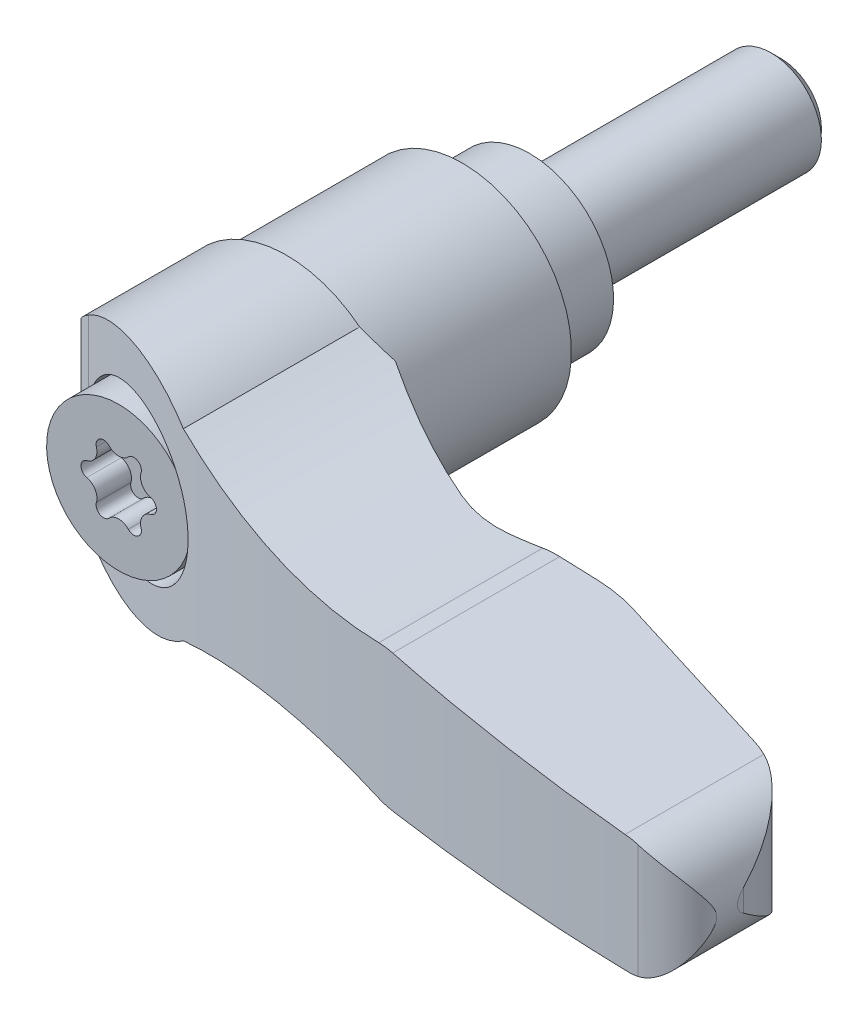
ISO-10303-21;
HEADER;
FILE_DESCRIPTION(('STEP AP214'),'2;1');
FILE_NAME('part.step','',(''),(''),'','','');
FILE_SCHEMA(('AUTOMOTIVE_DESIGN { 1 0 10303 214 1 1 1 1 }'));
ENDSEC;
DATA;
#1=APPLICATION_CONTEXT('core data for automotive mechanical design processes');
#2=APPLICATION_PROTOCOL_DEFINITION('international standard','automotive_design',2000,#1);
#3=PRODUCT_CONTEXT('',#1,'mechanical');
#4=PRODUCT('Part','Part','',(#3));
#5=PRODUCT_RELATED_PRODUCT_CATEGORY('part','',(#4));
#6=PRODUCT_DEFINITION_FORMATION('','',#4);
#7=PRODUCT_DEFINITION_CONTEXT('part definition',#1,'design');
#8=PRODUCT_DEFINITION('design','',#6,#7);
#9=PRODUCT_DEFINITION_SHAPE('','',#8);
#10=(LENGTH_UNIT() NAMED_UNIT(*) SI_UNIT(.MILLI.,.METRE.));
#11=(NAMED_UNIT(*) PLANE_ANGLE_UNIT() SI_UNIT($,.RADIAN.));
#12=(NAMED_UNIT(*) SI_UNIT($,.STERADIAN.) SOLID_ANGLE_UNIT());
#13=UNCERTAINTY_MEASURE_WITH_UNIT(LENGTH_MEASURE(1.E-05),#10,'distance_accuracy_value','');
#14=(GEOMETRIC_REPRESENTATION_CONTEXT(3) GLOBAL_UNCERTAINTY_ASSIGNED_CONTEXT((#13)) GLOBAL_UNIT_ASSIGNED_CONTEXT((#10,
#11,#12)) REPRESENTATION_CONTEXT('',''));
#15=CARTESIAN_POINT('',(0.,0.,0.));
#16=DIRECTION('',(0.,0.,1.));
#17=DIRECTION('',(1.,0.,0.));
#18=AXIS2_PLACEMENT_3D('',#15,#16,#17);
#19=CARTESIAN_POINT('',(0.,0.,-4.6928325));
#20=DIRECTION('',(0.,0.,-1.));
#21=DIRECTION('',(0.,1.,0.));
#22=AXIS2_PLACEMENT_3D('',#19,#20,#21);
#23=CYLINDRICAL_SURFACE('',#22,3.);
#24=CARTESIAN_POINT('',(0.,0.,-14.39));
#25=DIRECTION('',(0.,0.,-1.));
#26=DIRECTION('',(0.,1.,0.));
#27=AXIS2_PLACEMENT_3D('',#24,#25,#26);
#28=CIRCLE('',#27,3.);
#29=CARTESIAN_POINT('',(0.,3.,-14.39));
#30=VERTEX_POINT('',#29);
#31=EDGE_CURVE('E9',#30,#30,#28,.F.);
#32=ORIENTED_EDGE('',*,*,#31,.T.);
#33=EDGE_LOOP('',(#32));
#34=FACE_BOUND('',#33,.T.);
#35=CARTESIAN_POINT('',(0.,0.,0.));
#36=DIRECTION('',(0.,0.,-1.));
#37=DIRECTION('',(0.,1.,0.));
#38=AXIS2_PLACEMENT_3D('',#35,#36,#37);
#39=CIRCLE('',#38,3.);
#40=CARTESIAN_POINT('',(0.,3.,0.));
#41=VERTEX_POINT('',#40);
#42=EDGE_CURVE('E566',#41,#41,#39,.F.);
#43=ORIENTED_EDGE('',*,*,#42,.F.);
#44=EDGE_LOOP('',(#43));
#45=FACE_BOUND('',#44,.T.);
#46=ADVANCED_FACE('F15',(#34,#45),#23,.T.);
#47=CARTESIAN_POINT('',(4.,0.,0.));
#48=DIRECTION('',(0.,0.,-1.));
#49=DIRECTION('',(0.,1.,0.));
#50=AXIS2_PLACEMENT_3D('',#47,#48,#49);
#51=PLANE('',#50);
#52=ORIENTED_EDGE('',*,*,#42,.T.);
#53=EDGE_LOOP('',(#52));
#54=FACE_BOUND('',#53,.T.);
#55=CARTESIAN_POINT('',(0.,0.,0.));
#56=DIRECTION('',(0.,0.,-1.));
#57=DIRECTION('',(0.,1.,0.));
#58=AXIS2_PLACEMENT_3D('',#55,#56,#57);
#59=CIRCLE('',#58,5.);
#60=CARTESIAN_POINT('',(0.,5.,0.));
#61=VERTEX_POINT('',#60);
#62=EDGE_CURVE('E726',#61,#61,#59,.F.);
#63=ORIENTED_EDGE('',*,*,#62,.F.);
#64=EDGE_LOOP('',(#63));
#65=FACE_BOUND('',#64,.T.);
#66=ADVANCED_FACE('F669',(#54,#65),#51,.T.);
#67=CARTESIAN_POINT('',(0.,0.,6.4));
#68=DIRECTION('',(0.,0.,-1.));
#69=DIRECTION('',(0.,1.,0.));
#70=AXIS2_PLACEMENT_3D('',#67,#68,#69);
#71=CYLINDRICAL_SURFACE('',#70,5.);
#72=ORIENTED_EDGE('',*,*,#62,.T.);
#73=EDGE_LOOP('',(#72));
#74=FACE_BOUND('',#73,.T.);
#75=CARTESIAN_POINT('',(0.,0.,4.55000000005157));
#76=DIRECTION('',(0.,0.,-1.));
#77=DIRECTION('',(1.,0.,0.));
#78=AXIS2_PLACEMENT_3D('',#75,#76,#77);
#79=CIRCLE('',#78,4.99999999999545);
#80=CARTESIAN_POINT('',(4.99999999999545,0.,4.55000000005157));
#81=VERTEX_POINT('',#80);
#82=EDGE_CURVE('E559',#81,#81,#79,.T.);
#83=ORIENTED_EDGE('',*,*,#82,.T.);
#84=EDGE_LOOP('',(#83));
#85=FACE_BOUND('',#84,.T.);
#86=ADVANCED_FACE('F676',(#74,#85),#71,.T.);
#87=CARTESIAN_POINT('',(0.,0.,4.30000000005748));
#88=DIRECTION('',(0.,0.,-1.));
#89=DIRECTION('',(0.,1.,0.));
#90=AXIS2_PLACEMENT_3D('',#87,#88,#89);
#91=CONICAL_SURFACE('',#90,5.24999999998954,0.785398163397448);
#92=ORIENTED_EDGE('',*,*,#82,.F.);
#93=EDGE_LOOP('',(#92));
#94=FACE_BOUND('',#93,.T.);
#95=CARTESIAN_POINT('',(0.,0.,4.3));
#96=DIRECTION('',(0.,0.,-1.));
#97=DIRECTION('',(0.,1.,0.));
#98=AXIS2_PLACEMENT_3D('',#95,#96,#97);
#99=CIRCLE('',#98,5.25);
#100=CARTESIAN_POINT('',(0.,5.25,4.3));
#101=VERTEX_POINT('',#100);
#102=EDGE_CURVE('E555',#101,#101,#99,.T.);
#103=ORIENTED_EDGE('',*,*,#102,.T.);
#104=EDGE_LOOP('',(#103));
#105=FACE_BOUND('',#104,.T.);
#106=ADVANCED_FACE('F684',(#94,#105),#91,.F.);
#107=CARTESIAN_POINT('',(0.,0.,3.65));
#108=DIRECTION('',(0.,0.,-1.));
#109=DIRECTION('',(0.,1.,0.));
#110=AXIS2_PLACEMENT_3D('',#107,#108,#109);
#111=CYLINDRICAL_SURFACE('',#110,5.25);
#112=ORIENTED_EDGE('',*,*,#102,.F.);
#113=EDGE_LOOP('',(#112));
#114=FACE_BOUND('',#113,.T.);
#115=CARTESIAN_POINT('',(0.,0.,4.));
#116=DIRECTION('',(0.,0.,-1.));
#117=DIRECTION('',(0.,1.,0.));
#118=AXIS2_PLACEMENT_3D('',#115,#116,#117);
#119=CIRCLE('',#118,5.25);
#120=CARTESIAN_POINT('',(0.,5.25,4.));
#121=VERTEX_POINT('',#120);
#122=EDGE_CURVE('E714',#121,#121,#119,.F.);
#123=ORIENTED_EDGE('',*,*,#122,.F.);
#124=EDGE_LOOP('',(#123));
#125=FACE_BOUND('',#124,.T.);
#126=ADVANCED_FACE('F691',(#114,#125),#111,.F.);
#127=CARTESIAN_POINT('',(-6.36002265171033,-14.,4.));
#128=DIRECTION('',(0.707106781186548,0.,0.707106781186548));
#129=DIRECTION('',(-0.707106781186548,0.,0.707106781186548));
#130=AXIS2_PLACEMENT_3D('',#127,#128,#129);
#131=PLANE('',#130);
#132=DIRECTION('',(0.,1.,0.));
#133=VECTOR('',#132,1.);
#134=CARTESIAN_POINT('',(-6.36002265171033,0.,4.));
#135=LINE('',#134,#133);
#136=CARTESIAN_POINT('',(-6.36002265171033,-1.38824072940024,4.));
#137=VERTEX_POINT('',#136);
#138=CARTESIAN_POINT('',(-6.36002265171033,1.38824072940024,4.));
#139=VERTEX_POINT('',#138);
#140=EDGE_CURVE('E716',#137,#139,#135,.T.);
#141=ORIENTED_EDGE('',*,*,#140,.F.);
#142=CARTESIAN_POINT('',(-0.0100000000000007,0.,-2.35002265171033));
#143=DIRECTION('',(0.707106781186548,0.,0.707106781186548));
#144=DIRECTION('',(-0.707106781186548,0.,0.707106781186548));
#145=AXIS2_PLACEMENT_3D('',#142,#143,#144);
#146=ELLIPSE('',#145,9.19238815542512,6.5);
#147=EDGE_CURVE('E558',#139,#137,#146,.T.);
#148=ORIENTED_EDGE('',*,*,#147,.F.);
#149=EDGE_LOOP('',(#141,#148));
#150=FACE_BOUND('',#149,.T.);
#151=ADVANCED_FACE('F695',(#150),#131,.F.);
#152=CARTESIAN_POINT('',(-3.26,0.,4.));
#153=DIRECTION('',(0.,0.,-1.));
#154=DIRECTION('',(0.,1.,0.));
#155=AXIS2_PLACEMENT_3D('',#152,#153,#154);
#156=PLANE('',#155);
#157=CARTESIAN_POINT('',(-0.00999999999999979,0.,4.));
#158=DIRECTION('',(0.,0.,1.));
#159=DIRECTION('',(-1.,0.,0.));
#160=AXIS2_PLACEMENT_3D('',#157,#158,#159);
#161=CIRCLE('',#160,6.5);
#162=EDGE_CURVE('E710',#137,#139,#161,.T.);
#163=ORIENTED_EDGE('',*,*,#162,.F.);
#164=ORIENTED_EDGE('',*,*,#140,.T.);
#165=EDGE_LOOP('',(#163,#164));
#166=FACE_BOUND('',#165,.T.);
#167=ORIENTED_EDGE('',*,*,#122,.T.);
#168=EDGE_LOOP('',(#167));
#169=FACE_BOUND('',#168,.T.);
#170=ADVANCED_FACE('F698',(#166,#169),#156,.T.);
#171=CARTESIAN_POINT('',(39.9389658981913,-8.,27.2042491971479));
#172=DIRECTION('',(0.989626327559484,0.,-0.143665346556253));
#173=DIRECTION('',(0.143665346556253,0.,0.989626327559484));
#174=AXIS2_PLACEMENT_3D('',#171,#172,#173);
#175=PLANE('',#174);
#176=CARTESIAN_POINT('',(36.5,0.,3.51522972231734));
#177=DIRECTION('',(0.989626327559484,0.,-0.143665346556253));
#178=DIRECTION('',(0.143665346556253,0.,0.989626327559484));
#179=AXIS2_PLACEMENT_3D('',#176,#177,#178);
#180=ELLIPSE('',#179,24.3621728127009,3.5);
#181=CARTESIAN_POINT('',(39.9389658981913,-0.650779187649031,27.2042491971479));
#182=VERTEX_POINT('',#181);
#183=CARTESIAN_POINT('',(39.9389658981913,0.650779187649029,27.2042491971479));
#184=VERTEX_POINT('',#183);
#185=EDGE_CURVE('E462',#182,#184,#180,.F.);
#186=ORIENTED_EDGE('',*,*,#185,.F.);
#187=DIRECTION('',(0.,-1.,0.));
#188=VECTOR('',#187,1.);
#189=CARTESIAN_POINT('',(39.9389658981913,-8.,27.2042491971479));
#190=LINE('',#189,#188);
#191=EDGE_CURVE('E849',#184,#182,#190,.T.);
#192=ORIENTED_EDGE('',*,*,#191,.F.);
#193=EDGE_LOOP('',(#186,#192));
#194=FACE_BOUND('',#193,.T.);
#195=ADVANCED_FACE('F486',(#194),#175,.T.);
#196=CARTESIAN_POINT('',(33.8626602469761,-8.,28.0863544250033));
#197=DIRECTION('',(0.,-1.,0.));
#198=DIRECTION('',(1.,0.,0.));
#199=AXIS2_PLACEMENT_3D('',#196,#197,#198);
#200=CYLINDRICAL_SURFACE('',#199,6.14);
#201=ORIENTED_EDGE('',*,*,#191,.T.);
#202=CARTESIAN_POINT('',(36.5,-3.5,22.5416236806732));
#203=CARTESIAN_POINT('',(36.6061539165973,-3.50000941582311,22.5920863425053));
#204=CARTESIAN_POINT('',(36.7107657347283,-3.49517280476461,22.6456099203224));
#205=CARTESIAN_POINT('',(36.9160027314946,-3.47671082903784,22.758101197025));
#206=CARTESIAN_POINT('',(37.0166343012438,-3.46310021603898,22.8170596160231));
#207=CARTESIAN_POINT('',(37.2123479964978,-3.42816986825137,22.9392782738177));
#208=CARTESIAN_POINT('',(37.3074768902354,-3.40693163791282,23.002487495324));
#209=CARTESIAN_POINT('',(37.4929223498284,-3.3575759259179,23.13320682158));
#210=CARTESIAN_POINT('',(37.5832363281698,-3.32945478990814,23.2007191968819));
#211=CARTESIAN_POINT('',(37.7830795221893,-3.25850520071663,23.358740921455));
#212=CARTESIAN_POINT('',(37.8909927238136,-3.21376078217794,23.4504360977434));
#213=CARTESIAN_POINT('',(38.0982482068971,-3.11588681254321,23.6389903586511));
#214=CARTESIAN_POINT('',(38.1975840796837,-3.06275107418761,23.7358532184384));
#215=CARTESIAN_POINT('',(38.3880468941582,-2.94917464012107,23.9343090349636));
#216=CARTESIAN_POINT('',(38.4791322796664,-2.88870020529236,24.0359224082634));
#217=CARTESIAN_POINT('',(38.6526412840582,-2.76182607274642,24.2426721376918));
#218=CARTESIAN_POINT('',(38.7350674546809,-2.69542813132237,24.3478074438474));
#219=CARTESIAN_POINT('',(38.9229341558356,-2.52996933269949,24.6038856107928));
#220=CARTESIAN_POINT('',(39.0243159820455,-2.42850340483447,24.7562617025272));
#221=CARTESIAN_POINT('',(39.2111706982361,-2.21796613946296,25.0654781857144));
#222=CARTESIAN_POINT('',(39.2966363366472,-2.10889136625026,25.2223205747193));
#223=CARTESIAN_POINT('',(39.452222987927,-1.88493092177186,25.5392893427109));
#224=CARTESIAN_POINT('',(39.5223498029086,-1.77004746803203,25.699414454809));
#225=CARTESIAN_POINT('',(39.6478320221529,-1.53583460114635,26.0220530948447));
#226=CARTESIAN_POINT('',(39.7031929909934,-1.41650688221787,26.1845656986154));
#227=CARTESIAN_POINT('',(39.7933776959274,-1.1901857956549,26.4900634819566));
#228=CARTESIAN_POINT('',(39.8299343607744,-1.08360162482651,26.6328455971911));
#229=CARTESIAN_POINT('',(39.8923391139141,-0.86858691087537,26.918504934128));
#230=CARTESIAN_POINT('',(39.918226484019,-0.76016469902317,27.0613798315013));
#231=CARTESIAN_POINT('',(39.9389658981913,-0.650779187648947,27.204249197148));
#232=B_SPLINE_CURVE_WITH_KNOTS('',3,(#202,#203,#204,#205,#206,#207,#208,#209,#210,#211,#212,
#213,#214,#215,#216,#217,#218,#219,#220,#221,#222,#223,#224,#225,#226,#227,#228,#229,#230,#231),
.UNSPECIFIED.,.F.,.F.,(4,2,2,2,2,2,2,2,2,2,2,2,2,2,4),(0.,0.352350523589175,0.704110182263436,
1.05221781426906,1.40051067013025,1.84538152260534,2.29058194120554,2.73791274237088,
3.18511134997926,3.81198117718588,4.43913591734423,5.06605301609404,5.69273352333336,
6.23807905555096,6.78139842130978),.UNSPECIFIED.);
#233=CARTESIAN_POINT('',(36.5,-3.5,22.5416236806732));
#234=VERTEX_POINT('',#233);
#235=EDGE_CURVE('E466',#234,#182,#232,.T.);
#236=ORIENTED_EDGE('',*,*,#235,.F.);
#237=CARTESIAN_POINT('',(33.8626602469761,-3.59762871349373,28.0863544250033));
#238=DIRECTION('',(-0.0369925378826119,0.999315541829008,0.));
#239=DIRECTION('',(-0.999315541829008,-0.0369925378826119,0.));
#240=AXIS2_PLACEMENT_3D('',#237,#238,#239);
#241=ELLIPSE('',#240,6.14420545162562,6.14);
#242=CARTESIAN_POINT('',(35.5344609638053,-3.53574220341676,22.1783359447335));
#243=VERTEX_POINT('',#242);
#244=EDGE_CURVE('E718',#234,#243,#241,.T.);
#245=ORIENTED_EDGE('',*,*,#244,.T.);
#246=DIRECTION('',(0.,-1.,0.));
#247=VECTOR('',#246,1.);
#248=CARTESIAN_POINT('',(35.5344609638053,-8.,22.1783359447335));
#249=LINE('',#248,#247);
#250=CARTESIAN_POINT('',(35.5344609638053,3.53574220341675,22.1783359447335));
#251=VERTEX_POINT('',#250);
#252=EDGE_CURVE('E540',#251,#243,#249,.T.);
#253=ORIENTED_EDGE('',*,*,#252,.F.);
#254=CARTESIAN_POINT('',(33.8626602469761,3.59762871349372,28.0863544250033));
#255=DIRECTION('',(-0.036992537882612,-0.999315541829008,0.));
#256=DIRECTION('',(0.999315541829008,-0.036992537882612,0.));
#257=AXIS2_PLACEMENT_3D('',#254,#255,#256);
#258=ELLIPSE('',#257,6.14420545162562,6.14);
#259=CARTESIAN_POINT('',(36.5,3.5,22.5416236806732));
#260=VERTEX_POINT('',#259);
#261=EDGE_CURVE('E848',#251,#260,#258,.T.);
#262=ORIENTED_EDGE('',*,*,#261,.T.);
#263=CARTESIAN_POINT('',(39.9389658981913,0.65077918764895,27.204249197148));
#264=CARTESIAN_POINT('',(39.9247028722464,0.726086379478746,27.1059853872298));
#265=CARTESIAN_POINT('',(39.9079968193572,0.800887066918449,27.0076860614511));
#266=CARTESIAN_POINT('',(39.8696347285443,0.949458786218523,26.8112602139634));
#267=CARTESIAN_POINT('',(39.8479781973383,1.02322971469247,26.7131337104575));
#268=CARTESIAN_POINT('',(39.7995979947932,1.169880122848,26.5170899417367));
#269=CARTESIAN_POINT('',(39.7728626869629,1.24275713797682,26.4191736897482));
#270=CARTESIAN_POINT('',(39.7142815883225,1.38725410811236,26.2239599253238));
#271=CARTESIAN_POINT('',(39.6824358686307,1.4588740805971,26.1266624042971));
#272=CARTESIAN_POINT('',(39.5782917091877,1.67318502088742,25.8337016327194));
#273=CARTESIAN_POINT('',(39.4979263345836,1.81366367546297,25.6391889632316));
#274=CARTESIAN_POINT('',(39.3150854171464,2.08619457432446,25.2551202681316));
#275=CARTESIAN_POINT('',(39.2126344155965,2.218255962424,25.0655590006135));
#276=CARTESIAN_POINT('',(38.9595027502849,2.49877334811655,24.6523338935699));
#277=CARTESIAN_POINT('',(38.8031801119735,2.64456339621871,24.4302018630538));
#278=CARTESIAN_POINT('',(38.5417124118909,2.84488994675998,24.1082756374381));
#279=CARTESIAN_POINT('',(38.4501831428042,2.90854134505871,24.0029632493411));
#280=CARTESIAN_POINT('',(38.2579442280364,3.02861213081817,23.7967186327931));
#281=CARTESIAN_POINT('',(38.1572360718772,3.08503268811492,23.6957856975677));
#282=CARTESIAN_POINT('',(37.8892625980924,3.21757634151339,23.4457323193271));
#283=CARTESIAN_POINT('',(37.7155213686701,3.28779061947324,23.3001643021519));
#284=CARTESIAN_POINT('',(37.4396992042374,3.37286339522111,23.0946053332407));
#285=CARTESIAN_POINT('',(37.3453175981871,3.39783246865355,23.0282732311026));
#286=CARTESIAN_POINT('',(37.1517842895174,3.44019984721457,22.9003457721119));
#287=CARTESIAN_POINT('',(37.0526354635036,3.45760265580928,22.8387476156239));
#288=CARTESIAN_POINT('',(36.8781783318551,3.48029211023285,22.7372021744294));
#289=CARTESIAN_POINT('',(36.8038676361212,3.48759914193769,22.6959814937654));
#290=CARTESIAN_POINT('',(36.6533047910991,3.497455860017,22.6165121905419));
#291=CARTESIAN_POINT('',(36.5770513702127,3.50000234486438,22.5782655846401));
#292=CARTESIAN_POINT('',(36.5,3.5,22.5416236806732));
#293=B_SPLINE_CURVE_WITH_KNOTS('',3,(#263,#264,#265,#266,#267,#268,#269,#270,#271,#272,#273,
#274,#275,#276,#277,#278,#279,#280,#281,#282,#283,#284,#285,#286,#287,#288,#289,#290,#291,#292),
.UNSPECIFIED.,.F.,.F.,(4,2,2,2,2,2,2,2,2,2,2,2,2,2,4),(0.,0.373839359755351,0.747715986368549,
1.12245980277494,1.49719840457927,2.25512351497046,3.01221072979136,3.93367725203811,
4.39332639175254,4.85290107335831,5.56171222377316,5.91546495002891,6.26900683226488,
6.52468766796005,6.78054039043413),.UNSPECIFIED.);
#294=EDGE_CURVE('E435',#184,#260,#293,.T.);
#295=ORIENTED_EDGE('',*,*,#294,.F.);
#296=EDGE_LOOP('',(#201,#236,#245,#253,#262,#295));
#297=FACE_BOUND('',#296,.T.);
#298=ADVANCED_FACE('F480',(#297),#200,.T.);
#299=CARTESIAN_POINT('',(-0.0099999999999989,0.,10.28125));
#300=DIRECTION('',(0.,0.,1.));
#301=DIRECTION('',(-1.,0.,0.));
#302=AXIS2_PLACEMENT_3D('',#299,#300,#301);
#303=CYLINDRICAL_SURFACE('',#302,6.5);
#304=CARTESIAN_POINT('',(-0.00999999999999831,0.,14.5));
#305=DIRECTION('',(0.,0.,1.));
#306=DIRECTION('',(-1.,0.,0.));
#307=AXIS2_PLACEMENT_3D('',#304,#305,#306);
#308=CIRCLE('',#307,6.5);
#309=CARTESIAN_POINT('',(-6.51,0.,14.5));
#310=VERTEX_POINT('',#309);
#311=CARTESIAN_POINT('',(6.49,0.,14.5));
#312=VERTEX_POINT('',#311);
#313=EDGE_CURVE('E851',#310,#312,#308,.T.);
#314=ORIENTED_EDGE('',*,*,#313,.F.);
#315=CARTESIAN_POINT('',(-0.00999999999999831,0.,14.5));
#316=DIRECTION('',(0.,0.,1.));
#317=DIRECTION('',(-1.,0.,0.));
#318=AXIS2_PLACEMENT_3D('',#315,#316,#317);
#319=CIRCLE('',#318,6.5);
#320=EDGE_CURVE('E537',#312,#310,#319,.T.);
#321=ORIENTED_EDGE('',*,*,#320,.F.);
#322=EDGE_LOOP('',(#314,#321));
#323=FACE_BOUND('',#322,.T.);
#324=ORIENTED_EDGE('',*,*,#162,.T.);
#325=ORIENTED_EDGE('',*,*,#147,.T.);
#326=EDGE_LOOP('',(#324,#325));
#327=FACE_BOUND('',#326,.T.);
#328=ADVANCED_FACE('F485',(#323,#327),#303,.T.);
#329=CARTESIAN_POINT('',(-6.51,-8.,14.5));
#330=DIRECTION('',(0.,0.,-1.));
#331=DIRECTION('',(0.,1.,0.));
#332=AXIS2_PLACEMENT_3D('',#329,#330,#331);
#333=PLANE('',#332);
#334=ORIENTED_EDGE('',*,*,#313,.T.);
#335=DIRECTION('',(0.,-1.,0.));
#336=VECTOR('',#335,1.);
#337=CARTESIAN_POINT('',(6.49,-8.,14.5));
#338=LINE('',#337,#336);
#339=CARTESIAN_POINT('',(6.49,-4.77390244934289,14.5));
#340=VERTEX_POINT('',#339);
#341=EDGE_CURVE('E854',#312,#340,#338,.T.);
#342=ORIENTED_EDGE('',*,*,#341,.T.);
#343=CARTESIAN_POINT('',(14.8,-33.6,14.5));
#344=DIRECTION('',(0.,0.,1.));
#345=DIRECTION('',(0.,-1.,0.));
#346=AXIS2_PLACEMENT_3D('',#343,#344,#345);
#347=CIRCLE('',#346,30.);
#348=CARTESIAN_POINT('',(4.36278582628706,-5.47413005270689,14.5));
#349=VERTEX_POINT('',#348);
#350=EDGE_CURVE('E811',#340,#349,#347,.T.);
#351=ORIENTED_EDGE('',*,*,#350,.T.);
#352=CARTESIAN_POINT('',(0.,0.,14.5));
#353=DIRECTION('',(0.,0.,1.));
#354=DIRECTION('',(0.,-1.,0.));
#355=AXIS2_PLACEMENT_3D('',#352,#353,#354);
#356=CIRCLE('',#355,7.);
#357=CARTESIAN_POINT('',(-6.51,-2.57291663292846,14.5));
#358=VERTEX_POINT('',#357);
#359=EDGE_CURVE('E373',#358,#349,#356,.T.);
#360=ORIENTED_EDGE('',*,*,#359,.F.);
#361=DIRECTION('',(0.,-1.,0.));
#362=VECTOR('',#361,1.);
#363=CARTESIAN_POINT('',(-6.51,-8.,14.5));
#364=LINE('',#363,#362);
#365=EDGE_CURVE('E536',#310,#358,#364,.T.);
#366=ORIENTED_EDGE('',*,*,#365,.F.);
#367=EDGE_LOOP('',(#334,#342,#351,#360,#366));
#368=FACE_BOUND('',#367,.T.);
#369=ADVANCED_FACE('F491',(#368),#333,.T.);
#370=CARTESIAN_POINT('',(20.6060580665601,0.915064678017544,31.));
#371=DIRECTION('',(0.,0.,1.));
#372=DIRECTION('',(0.,-1.,0.));
#373=AXIS2_PLACEMENT_3D('',#370,#371,#372);
#374=CYLINDRICAL_SURFACE('',#373,5.);
#375=CARTESIAN_POINT('',(20.7910207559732,-4.08151303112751,28.9575923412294));
#376=CARTESIAN_POINT('',(20.6207575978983,-4.08776311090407,28.9275070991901));
#377=CARTESIAN_POINT('',(20.4510927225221,-4.08540030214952,28.8972050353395));
#378=CARTESIAN_POINT('',(20.1129595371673,-4.06344890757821,28.8361672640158));
#379=CARTESIAN_POINT('',(19.9444912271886,-4.04386032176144,28.8054315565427));
#380=CARTESIAN_POINT('',(19.7766211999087,-4.01565884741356,28.7744790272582));
#381=B_SPLINE_CURVE_WITH_KNOTS('',3,(#375,#376,#377,#378,#379,#380),.UNSPECIFIED.,.F.,.F.,(4,2,
4),(0.,0.517097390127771,1.03419478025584),.UNSPECIFIED.);
#382=CARTESIAN_POINT('',(20.7910207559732,-4.08151303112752,28.9575923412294));
#383=VERTEX_POINT('',#382);
#384=CARTESIAN_POINT('',(19.7766211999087,-4.01565884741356,28.7744790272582));
#385=VERTEX_POINT('',#384);
#386=EDGE_CURVE('E469',#383,#385,#381,.T.);
#387=ORIENTED_EDGE('',*,*,#386,.T.);
#388=DIRECTION('',(0.,0.,1.));
#389=VECTOR('',#388,1.);
#390=CARTESIAN_POINT('',(19.7766211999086,-4.01565884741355,31.));
#391=LINE('',#390,#389);
#392=CARTESIAN_POINT('',(19.7766211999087,-4.01565884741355,19.));
#393=VERTEX_POINT('',#392);
#394=EDGE_CURVE('E804',#385,#393,#391,.F.);
#395=ORIENTED_EDGE('',*,*,#394,.T.);
#396=CARTESIAN_POINT('',(20.6060580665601,0.915064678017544,19.));
#397=DIRECTION('',(0.,0.,1.));
#398=DIRECTION('',(0.,-1.,0.));
#399=AXIS2_PLACEMENT_3D('',#396,#397,#398);
#400=CIRCLE('',#399,5.);
#401=CARTESIAN_POINT('',(20.7910207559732,-4.08151303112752,19.));
#402=VERTEX_POINT('',#401);
#403=EDGE_CURVE('E858',#402,#393,#400,.F.);
#404=ORIENTED_EDGE('',*,*,#403,.F.);
#405=DIRECTION('',(0.,0.,1.));
#406=VECTOR('',#405,1.);
#407=CARTESIAN_POINT('',(20.7910207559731,-4.08151303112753,31.));
#408=LINE('',#407,#406);
#409=EDGE_CURVE('E810',#402,#383,#408,.T.);
#410=ORIENTED_EDGE('',*,*,#409,.T.);
#411=EDGE_LOOP('',(#387,#395,#404,#410));
#412=FACE_BOUND('',#411,.T.);
#413=ADVANCED_FACE('F427',(#412),#374,.T.);
#414=CARTESIAN_POINT('',(36.5,0.,31.));
#415=DIRECTION('',(0.,0.,1.));
#416=DIRECTION('',(0.,-1.,0.));
#417=AXIS2_PLACEMENT_3D('',#414,#415,#416);
#418=CYLINDRICAL_SURFACE('',#417,3.5);
#419=CARTESIAN_POINT('',(37.3240183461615,-3.40161634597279,30.8631619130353));
#420=CARTESIAN_POINT('',(37.188603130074,-3.43435641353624,30.8557619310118));
#421=CARTESIAN_POINT('',(37.0522273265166,-3.45892508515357,30.8481012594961));
#422=CARTESIAN_POINT('',(36.7775545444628,-3.49171963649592,30.8322585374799));
#423=CARTESIAN_POINT('',(36.6392575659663,-3.499945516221,30.8240764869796));
#424=CARTESIAN_POINT('',(36.5,-3.5,30.815633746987));
#425=B_SPLINE_CURVE_WITH_KNOTS('',3,(#419,#420,#421,#422,#423,#424),.UNSPECIFIED.,.F.,.F.,(4,2,
4),(0.,0.416348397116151,0.832696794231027),.UNSPECIFIED.);
#426=CARTESIAN_POINT('',(37.3240183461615,-3.40161634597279,30.8631619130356));
#427=VERTEX_POINT('',#426);
#428=CARTESIAN_POINT('',(36.5,-3.5,30.815633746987));
#429=VERTEX_POINT('',#428);
#430=EDGE_CURVE('E447',#427,#429,#425,.T.);
#431=ORIENTED_EDGE('',*,*,#430,.T.);
#432=DIRECTION('',(0.,0.,1.));
#433=VECTOR('',#432,1.);
#434=CARTESIAN_POINT('',(36.5,-3.5,31.));
#435=LINE('',#434,#433);
#436=EDGE_CURVE('E821',#429,#234,#435,.F.);
#437=ORIENTED_EDGE('',*,*,#436,.T.);
#438=ORIENTED_EDGE('',*,*,#235,.T.);
#439=ORIENTED_EDGE('',*,*,#185,.T.);
#440=ORIENTED_EDGE('',*,*,#294,.T.);
#441=DIRECTION('',(0.,0.,1.));
#442=VECTOR('',#441,1.);
#443=CARTESIAN_POINT('',(36.5,3.5,31.));
#444=LINE('',#443,#442);
#445=CARTESIAN_POINT('',(36.5,3.5,30.815633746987));
#446=VERTEX_POINT('',#445);
#447=EDGE_CURVE('E415',#260,#446,#444,.T.);
#448=ORIENTED_EDGE('',*,*,#447,.T.);
#449=CARTESIAN_POINT('',(36.5,3.5,30.815633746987));
#450=CARTESIAN_POINT('',(36.6392575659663,3.499945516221,30.8240764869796));
#451=CARTESIAN_POINT('',(36.7775545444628,3.49171963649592,30.8322585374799));
#452=CARTESIAN_POINT('',(37.0522273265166,3.45892508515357,30.8481012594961));
#453=CARTESIAN_POINT('',(37.188603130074,3.43435641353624,30.8557619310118));
#454=CARTESIAN_POINT('',(37.3240183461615,3.40161634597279,30.8631619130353));
#455=B_SPLINE_CURVE_WITH_KNOTS('',3,(#449,#450,#451,#452,#453,#454),.UNSPECIFIED.,.F.,.F.,(4,2,
4),(0.,0.416348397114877,0.832696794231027),.UNSPECIFIED.);
#456=CARTESIAN_POINT('',(37.3240183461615,3.40161634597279,30.8631619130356));
#457=VERTEX_POINT('',#456);
#458=EDGE_CURVE('E453',#446,#457,#455,.T.);
#459=ORIENTED_EDGE('',*,*,#458,.T.);
#460=CARTESIAN_POINT('',(37.3240183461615,-3.40161634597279,30.8631619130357));
#461=CARTESIAN_POINT('',(37.391971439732,-3.38517327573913,30.8668921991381));
#462=CARTESIAN_POINT('',(37.4595366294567,-3.36663320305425,30.8678982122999));
#463=CARTESIAN_POINT('',(37.5932555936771,-3.32560440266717,30.8647814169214));
#464=CARTESIAN_POINT('',(37.6594109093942,-3.30312026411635,30.8606645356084));
#465=CARTESIAN_POINT('',(37.7892420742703,-3.25463078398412,30.8476880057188));
#466=CARTESIAN_POINT('',(37.8529349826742,-3.22865926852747,30.8388717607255));
#467=CARTESIAN_POINT('',(37.9780608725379,-3.17332967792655,30.8169101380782));
#468=CARTESIAN_POINT('',(38.0394932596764,-3.14397072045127,30.8037636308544));
#469=CARTESIAN_POINT('',(38.2193405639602,-3.05154774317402,30.7585650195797));
#470=CARTESIAN_POINT('',(38.3339861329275,-2.98387991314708,30.7206782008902));
#471=CARTESIAN_POINT('',(38.5517467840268,-2.83858348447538,30.6324207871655));
#472=CARTESIAN_POINT('',(38.6548343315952,-2.76093200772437,30.5820212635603));
#473=CARTESIAN_POINT('',(38.8266237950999,-2.61655584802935,30.4842690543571));
#474=CARTESIAN_POINT('',(38.8977926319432,-2.55140368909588,30.4388637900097));
#475=CARTESIAN_POINT('',(39.0330318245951,-2.41719472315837,30.3433991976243));
#476=CARTESIAN_POINT('',(39.0970985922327,-2.34813596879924,30.2933375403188));
#477=CARTESIAN_POINT('',(39.2184581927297,-2.20651617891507,30.1893556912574));
#478=CARTESIAN_POINT('',(39.2757265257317,-2.13394372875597,30.1354226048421));
#479=CARTESIAN_POINT('',(39.3834200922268,-1.9860149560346,30.0247265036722));
#480=CARTESIAN_POINT('',(39.4338475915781,-1.91065956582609,29.9679644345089));
#481=CARTESIAN_POINT('',(39.542421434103,-1.73419420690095,29.8348143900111));
#482=CARTESIAN_POINT('',(39.598263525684,-1.63221056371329,29.7576996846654));
#483=CARTESIAN_POINT('',(39.699250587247,-1.42414609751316,29.601672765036));
#484=CARTESIAN_POINT('',(39.7443776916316,-1.31805876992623,29.5227577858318));
#485=CARTESIAN_POINT('',(39.8239747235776,-1.10201279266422,29.3659397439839));
#486=CARTESIAN_POINT('',(39.8584944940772,-0.992075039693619,29.2880336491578));
#487=CARTESIAN_POINT('',(39.9024720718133,-0.82253324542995,29.1754655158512));
#488=CARTESIAN_POINT('',(39.9158188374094,-0.765322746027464,29.13870216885));
#489=CARTESIAN_POINT('',(39.9398686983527,-0.648731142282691,29.0678855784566));
#490=CARTESIAN_POINT('',(39.9505741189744,-0.589352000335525,29.0338299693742));
#491=CARTESIAN_POINT('',(39.9677206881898,-0.477086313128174,28.9756719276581));
#492=CARTESIAN_POINT('',(39.974567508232,-0.424644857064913,28.9508463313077));
#493=CARTESIAN_POINT('',(39.9860225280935,-0.317100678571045,28.907341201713));
#494=CARTESIAN_POINT('',(39.9906385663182,-0.262008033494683,28.8886402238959));
#495=CARTESIAN_POINT('',(39.9966232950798,-0.160247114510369,28.8637621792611));
#496=CARTESIAN_POINT('',(39.9984523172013,-0.114054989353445,28.8558445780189));
#497=CARTESIAN_POINT('',(40.0002450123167,-0.0209847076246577,28.8480882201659));
#498=CARTESIAN_POINT('',(40.0002117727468,0.0258921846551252,28.8482360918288));
#499=CARTESIAN_POINT('',(39.9982952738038,0.118672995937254,28.8565205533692));
#500=CARTESIAN_POINT('',(39.9964185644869,0.164579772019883,28.8646288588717));
#501=CARTESIAN_POINT('',(39.9910078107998,0.254792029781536,28.8870889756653));
#502=CARTESIAN_POINT('',(39.9874686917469,0.299092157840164,28.9014598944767));
#503=CARTESIAN_POINT('',(39.9768286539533,0.407331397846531,28.9425912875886));
#504=CARTESIAN_POINT('',(39.9688318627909,0.470155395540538,28.9719647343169));
#505=CARTESIAN_POINT('',(39.9499914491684,0.592804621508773,29.0357410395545));
#506=CARTESIAN_POINT('',(39.9391403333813,0.652621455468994,29.0701570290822));
#507=CARTESIAN_POINT('',(39.9146680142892,0.770512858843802,29.1419527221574));
#508=CARTESIAN_POINT('',(39.9010255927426,0.828569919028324,29.1793537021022));
#509=CARTESIAN_POINT('',(39.8711029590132,0.942947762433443,29.2555520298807));
#510=CARTESIAN_POINT('',(39.8548256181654,0.999270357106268,29.2943478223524));
#511=CARTESIAN_POINT('',(39.8016739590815,1.1674299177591,29.4125134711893));
#512=CARTESIAN_POINT('',(39.7607265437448,1.27728939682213,29.4929030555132));
#513=CARTESIAN_POINT('',(39.6677865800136,1.49294867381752,29.6529500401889));
#514=CARTESIAN_POINT('',(39.6157834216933,1.59874445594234,29.7326066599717));
#515=CARTESIAN_POINT('',(39.5005966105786,1.80564912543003,29.8886982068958));
#516=CARTESIAN_POINT('',(39.4374685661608,1.90677830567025,29.9651469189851));
#517=CARTESIAN_POINT('',(39.2994325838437,2.10420227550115,30.1133265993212));
#518=CARTESIAN_POINT('',(39.2245348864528,2.20050117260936,30.1850615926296));
#519=CARTESIAN_POINT('',(39.0442952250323,2.40820732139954,30.3372677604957));
#520=CARTESIAN_POINT('',(38.9358891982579,2.51819093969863,30.4161164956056));
#521=CARTESIAN_POINT('',(38.7000552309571,2.72661786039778,30.559662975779));
#522=CARTESIAN_POINT('',(38.5726400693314,2.82506883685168,30.6243701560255));
#523=CARTESIAN_POINT('',(38.3254291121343,2.98922527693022,30.7237895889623));
#524=CARTESIAN_POINT('',(38.2087731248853,3.05759969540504,30.7618633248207));
#525=CARTESIAN_POINT('',(37.9650872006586,3.18151973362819,30.8217517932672));
#526=CARTESIAN_POINT('',(37.8380870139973,3.23710049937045,30.8436114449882));
#527=CARTESIAN_POINT('',(37.6449762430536,3.3080955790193,30.8616374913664));
#528=CARTESIAN_POINT('',(37.5816159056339,3.32934954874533,30.8652564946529));
#529=CARTESIAN_POINT('',(37.4536360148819,3.36824327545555,30.867801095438));
#530=CARTESIAN_POINT('',(37.389015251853,3.38587935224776,30.8667219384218));
#531=CARTESIAN_POINT('',(37.3240183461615,3.40161634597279,30.8631619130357));
#532=B_SPLINE_CURVE_WITH_KNOTS('',3,(#460,#461,#462,#463,#464,#465,#466,#467,#468,#469,#470,
#471,#472,#473,#474,#475,#476,#477,#478,#479,#480,#481,#482,#483,#484,#485,#486,#487,#488,#489,
#490,#491,#492,#493,#494,#495,#496,#497,#498,#499,#500,#501,#502,#503,#504,#505,#506,#507,#508,
#509,#510,#511,#512,#513,#514,#515,#516,#517,#518,#519,#520,#521,#522,#523,#524,#525,#526,#527,
#528,#529,#530,#531),.UNSPECIFIED.,.F.,.F.,(4,2,2,2,2,2,2,2,2,2,2,2,2,2,2,2,2,2,2,2,2,2,2,2,2,2,
2,2,2,2,2,2,2,2,2,4),(0.,0.20991378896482,0.419584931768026,0.62735226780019,0.83517384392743,
1.2486492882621,1.66308971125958,1.98257890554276,2.30222878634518,2.62299771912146,
2.94366014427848,3.36167065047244,3.78037330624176,4.19707731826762,4.40489951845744,
4.61253810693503,4.78756393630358,4.9619702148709,5.10204921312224,5.24189598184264,
5.38124764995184,5.52102749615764,5.72989301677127,5.9393124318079,6.15038720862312,
6.36123350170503,6.7871576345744,7.21349237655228,7.63775356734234,8.06164764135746,
8.58013018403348,9.09826573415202,9.51811060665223,9.9367879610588,10.1373304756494,
10.3380759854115),.UNSPECIFIED.);
#533=EDGE_CURVE('E407',#427,#457,#532,.T.);
#534=ORIENTED_EDGE('',*,*,#533,.F.);
#535=EDGE_LOOP('',(#431,#437,#438,#439,#440,#448,#459,#534));
#536=FACE_BOUND('',#535,.T.);
#537=ADVANCED_FACE('F421',(#536),#418,.T.);
#538=CARTESIAN_POINT('',(23.0466685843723,-8.,28.05));
#539=DIRECTION('',(0.,-1.,0.));
#540=DIRECTION('',(1.,0.,0.));
#541=AXIS2_PLACEMENT_3D('',#538,#539,#540);
#542=CYLINDRICAL_SURFACE('',#541,9.05000000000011);
#543=CARTESIAN_POINT('',(23.0466685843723,3.99801374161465,28.05));
#544=DIRECTION('',(-0.036992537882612,-0.999315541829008,0.));
#545=DIRECTION('',(0.999315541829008,-0.036992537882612,0.));
#546=AXIS2_PLACEMENT_3D('',#543,#544,#545);
#547=ELLIPSE('',#546,9.05619858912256,9.05000000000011);
#548=CARTESIAN_POINT('',(23.0466685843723,3.99801374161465,19.));
#549=VERTEX_POINT('',#548);
#550=CARTESIAN_POINT('',(25.5108048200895,3.90679665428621,19.34192715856));
#551=VERTEX_POINT('',#550);
#552=EDGE_CURVE('E403',#549,#551,#547,.T.);
#553=ORIENTED_EDGE('',*,*,#552,.T.);
#554=DIRECTION('',(0.,-1.,0.));
#555=VECTOR('',#554,1.);
#556=CARTESIAN_POINT('',(25.5108048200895,-8.,19.34192715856));
#557=LINE('',#556,#555);
#558=CARTESIAN_POINT('',(25.5108048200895,-3.90679665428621,19.34192715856));
#559=VERTEX_POINT('',#558);
#560=EDGE_CURVE('E460',#559,#551,#557,.F.);
#561=ORIENTED_EDGE('',*,*,#560,.F.);
#562=CARTESIAN_POINT('',(23.0466685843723,-3.99801374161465,28.05));
#563=DIRECTION('',(-0.0369925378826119,0.999315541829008,0.));
#564=DIRECTION('',(-0.999315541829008,-0.0369925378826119,0.));
#565=AXIS2_PLACEMENT_3D('',#562,#563,#564);
#566=ELLIPSE('',#565,9.05619858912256,9.05000000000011);
#567=CARTESIAN_POINT('',(23.0466685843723,-3.99801374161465,19.));
#568=VERTEX_POINT('',#567);
#569=EDGE_CURVE('E417',#559,#568,#566,.T.);
#570=ORIENTED_EDGE('',*,*,#569,.T.);
#571=DIRECTION('',(0.,1.,0.));
#572=VECTOR('',#571,1.);
#573=CARTESIAN_POINT('',(23.0466685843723,-8.,19.));
#574=LINE('',#573,#572);
#575=EDGE_CURVE('E544',#549,#568,#574,.F.);
#576=ORIENTED_EDGE('',*,*,#575,.F.);
#577=EDGE_LOOP('',(#553,#561,#570,#576));
#578=FACE_BOUND('',#577,.T.);
#579=ADVANCED_FACE('F426',(#578),#542,.T.);
#580=CARTESIAN_POINT('',(25.5108048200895,-8.,19.34192715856));
#581=DIRECTION('',(0.272280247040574,0.,-0.962217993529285));
#582=DIRECTION('',(0.962217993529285,0.,0.272280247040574));
#583=AXIS2_PLACEMENT_3D('',#580,#581,#582);
#584=PLANE('',#583);
#585=DIRECTION('',(0.961608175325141,-0.0355966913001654,0.272107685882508));
#586=VECTOR('',#585,1.);
#587=CARTESIAN_POINT('',(25.5108048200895,3.90679665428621,19.34192715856));
#588=LINE('',#587,#586);
#589=EDGE_CURVE('E405',#551,#251,#588,.T.);
#590=ORIENTED_EDGE('',*,*,#589,.T.);
#591=ORIENTED_EDGE('',*,*,#252,.T.);
#592=DIRECTION('',(-0.961608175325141,-0.0355966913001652,-0.272107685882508));
#593=VECTOR('',#592,1.);
#594=CARTESIAN_POINT('',(35.5344609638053,-3.53574220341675,22.1783359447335));
#595=LINE('',#594,#593);
#596=EDGE_CURVE('E818',#243,#559,#595,.T.);
#597=ORIENTED_EDGE('',*,*,#596,.T.);
#598=ORIENTED_EDGE('',*,*,#560,.T.);
#599=EDGE_LOOP('',(#590,#591,#597,#598));
#600=FACE_BOUND('',#599,.T.);
#601=ADVANCED_FACE('F876',(#600),#584,.T.);
#602=CARTESIAN_POINT('',(20.60605806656,-0.915064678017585,31.));
#603=DIRECTION('',(0.,0.,1.));
#604=DIRECTION('',(0.,-1.,0.));
#605=AXIS2_PLACEMENT_3D('',#602,#603,#604);
#606=CYLINDRICAL_SURFACE('',#605,5.00000000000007);
#607=CARTESIAN_POINT('',(19.7766211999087,4.01565884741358,28.7744790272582));
#608=CARTESIAN_POINT('',(19.9444912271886,4.04386032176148,28.8054315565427));
#609=CARTESIAN_POINT('',(20.1129595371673,4.06344890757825,28.8361672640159));
#610=CARTESIAN_POINT('',(20.4510927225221,4.08540030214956,28.8972050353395));
#611=CARTESIAN_POINT('',(20.6207575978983,4.08776311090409,28.9275070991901));
#612=CARTESIAN_POINT('',(20.7910207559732,4.08151303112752,28.9575923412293));
#613=B_SPLINE_CURVE_WITH_KNOTS('',3,(#607,#608,#609,#610,#611,#612),.UNSPECIFIED.,.F.,.F.,(4,2,
4),(0.,0.517097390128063,1.03419478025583),.UNSPECIFIED.);
#614=CARTESIAN_POINT('',(19.7766211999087,4.01565884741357,28.7744790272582));
#615=VERTEX_POINT('',#614);
#616=CARTESIAN_POINT('',(20.7910207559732,4.08151303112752,28.9575923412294));
#617=VERTEX_POINT('',#616);
#618=EDGE_CURVE('E543',#615,#617,#613,.T.);
#619=ORIENTED_EDGE('',*,*,#618,.T.);
#620=DIRECTION('',(0.,0.,1.));
#621=VECTOR('',#620,1.);
#622=CARTESIAN_POINT('',(20.7910207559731,4.08151303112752,31.));
#623=LINE('',#622,#621);
#624=CARTESIAN_POINT('',(20.7910207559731,4.08151303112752,19.));
#625=VERTEX_POINT('',#624);
#626=EDGE_CURVE('E829',#617,#625,#623,.F.);
#627=ORIENTED_EDGE('',*,*,#626,.T.);
#628=CARTESIAN_POINT('',(20.60605806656,-0.915064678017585,19.));
#629=DIRECTION('',(0.,0.,1.));
#630=DIRECTION('',(0.,-1.,0.));
#631=AXIS2_PLACEMENT_3D('',#628,#629,#630);
#632=CIRCLE('',#631,5.00000000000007);
#633=CARTESIAN_POINT('',(19.7766211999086,4.01565884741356,19.));
#634=VERTEX_POINT('',#633);
#635=EDGE_CURVE('E548',#634,#625,#632,.F.);
#636=ORIENTED_EDGE('',*,*,#635,.F.);
#637=DIRECTION('',(0.,0.,1.));
#638=VECTOR('',#637,1.);
#639=CARTESIAN_POINT('',(19.7766211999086,4.01565884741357,31.));
#640=LINE('',#639,#638);
#641=EDGE_CURVE('E402',#634,#615,#640,.T.);
#642=ORIENTED_EDGE('',*,*,#641,.T.);
#643=EDGE_LOOP('',(#619,#627,#636,#642));
#644=FACE_BOUND('',#643,.T.);
#645=ADVANCED_FACE('F873',(#644),#606,.T.);
#646=CARTESIAN_POINT('',(42.8289340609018,-8.,-49.9630271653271));
#647=DIRECTION('',(0.,-1.,0.));
#648=DIRECTION('',(1.,0.,0.));
#649=AXIS2_PLACEMENT_3D('',#646,#647,#648);
#650=CYLINDRICAL_SURFACE('',#649,74.0000000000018);
#651=DIRECTION('',(0.,-1.,0.));
#652=VECTOR('',#651,1.);
#653=CARTESIAN_POINT('',(14.2560355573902,-8.,18.2981585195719));
#654=LINE('',#653,#652);
#655=CARTESIAN_POINT('',(14.2560355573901,3.60493202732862,18.2981585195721));
#656=VERTEX_POINT('',#655);
#657=CARTESIAN_POINT('',(14.2560355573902,-3.60493202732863,18.2981585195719));
#658=VERTEX_POINT('',#657);
#659=EDGE_CURVE('E856',#656,#658,#654,.T.);
#660=ORIENTED_EDGE('',*,*,#659,.T.);
#661=CARTESIAN_POINT('',(14.2560355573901,-3.60493202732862,18.2981585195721));
#662=CARTESIAN_POINT('',(13.91912090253,-3.61104217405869,18.1571345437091));
#663=CARTESIAN_POINT('',(13.5833701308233,-3.62280963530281,18.0136612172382));
#664=CARTESIAN_POINT('',(12.9145226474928,-3.65743626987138,17.7219861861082));
#665=CARTESIAN_POINT('',(12.5814258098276,-3.68029491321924,17.5737847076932));
#666=CARTESIAN_POINT('',(11.5893580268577,-3.7649360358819,17.1235938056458));
#667=CARTESIAN_POINT('',(10.9347595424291,-3.84283944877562,16.8148240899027));
#668=CARTESIAN_POINT('',(9.64003521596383,-4.03983028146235,16.1808788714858));
#669=CARTESIAN_POINT('',(8.99990836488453,-4.15891482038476,15.8557045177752));
#670=CARTESIAN_POINT('',(7.73340291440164,-4.43691869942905,15.1892512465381));
#671=CARTESIAN_POINT('',(7.10709183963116,-4.5960001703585,14.8479114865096));
#672=CARTESIAN_POINT('',(6.49,-4.77390244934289,14.5));
#673=B_SPLINE_CURVE_WITH_KNOTS('',3,(#661,#662,#663,#664,#665,#666,#667,#668,#669,#670,#671,
#672),.UNSPECIFIED.,.F.,.F.,(4,2,2,2,2,4),(0.,1.09575278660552,2.19145321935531,
4.37360080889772,6.55559577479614,8.74658240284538),.UNSPECIFIED.);
#674=EDGE_CURVE('E357',#658,#340,#673,.T.);
#675=ORIENTED_EDGE('',*,*,#674,.T.);
#676=ORIENTED_EDGE('',*,*,#341,.F.);
#677=DIRECTION('',(0.,1.,0.));
#678=VECTOR('',#677,1.);
#679=CARTESIAN_POINT('',(6.49,-8.,14.5));
#680=LINE('',#679,#678);
#681=CARTESIAN_POINT('',(6.49,4.77390244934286,14.5));
#682=VERTEX_POINT('',#681);
#683=EDGE_CURVE('E547',#682,#312,#680,.F.);
#684=ORIENTED_EDGE('',*,*,#683,.F.);
#685=CARTESIAN_POINT('',(6.49,4.77390244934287,14.5));
#686=CARTESIAN_POINT('',(7.10709183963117,4.59600017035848,14.8479114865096));
#687=CARTESIAN_POINT('',(7.73340291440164,4.43691869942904,15.1892512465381));
#688=CARTESIAN_POINT('',(8.99990836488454,4.15891482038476,15.8557045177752));
#689=CARTESIAN_POINT('',(9.64003521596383,4.03983028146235,16.1808788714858));
#690=CARTESIAN_POINT('',(10.9347595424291,3.84283944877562,16.8148240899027));
#691=CARTESIAN_POINT('',(11.5893580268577,3.7649360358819,17.1235938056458));
#692=CARTESIAN_POINT('',(12.5814258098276,3.68029491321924,17.5737847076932));
#693=CARTESIAN_POINT('',(12.9145226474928,3.65743626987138,17.7219861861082));
#694=CARTESIAN_POINT('',(13.5833701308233,3.62280963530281,18.0136612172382));
#695=CARTESIAN_POINT('',(13.91912090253,3.61104217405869,18.1571345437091));
#696=CARTESIAN_POINT('',(14.2560355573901,3.60493202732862,18.2981585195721));
#697=B_SPLINE_CURVE_WITH_KNOTS('',3,(#685,#686,#687,#688,#689,#690,#691,#692,#693,#694,#695,
#696),.UNSPECIFIED.,.F.,.F.,(4,2,2,2,2,4),(0.,2.19098662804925,4.37298159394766,
6.55512918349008,7.65082961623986,8.74658240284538),.UNSPECIFIED.);
#698=EDGE_CURVE('E393',#682,#656,#697,.T.);
#699=ORIENTED_EDGE('',*,*,#698,.T.);
#700=EDGE_LOOP('',(#660,#675,#676,#684,#699));
#701=FACE_BOUND('',#700,.T.);
#702=ADVANCED_FACE('F380',(#701),#650,.F.);
#703=CARTESIAN_POINT('',(17.7504238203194,-8.,9.95000000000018));
#704=DIRECTION('',(0.,-1.,0.));
#705=DIRECTION('',(1.,0.,0.));
#706=AXIS2_PLACEMENT_3D('',#703,#704,#705);
#707=CYLINDRICAL_SURFACE('',#706,9.04999999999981);
#708=ORIENTED_EDGE('',*,*,#659,.F.);
#709=CARTESIAN_POINT('',(14.2560355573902,3.60493202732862,18.2981585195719));
#710=CARTESIAN_POINT('',(14.483816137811,3.60077563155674,18.3935396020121));
#711=CARTESIAN_POINT('',(14.7155749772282,3.59919241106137,18.4795580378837));
#712=CARTESIAN_POINT('',(15.1854578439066,3.60156277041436,18.6324166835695));
#713=CARTESIAN_POINT('',(15.4235855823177,3.60551965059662,18.699245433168));
#714=CARTESIAN_POINT('',(15.9002362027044,3.61924836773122,18.8121846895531));
#715=CARTESIAN_POINT('',(16.1386829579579,3.62891979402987,18.8586293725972));
#716=CARTESIAN_POINT('',(16.6180975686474,3.65418161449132,18.9321530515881));
#717=CARTESIAN_POINT('',(16.8590635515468,3.66976787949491,18.9592455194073));
#718=CARTESIAN_POINT('',(17.2084780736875,3.69663888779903,18.9844088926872));
#719=CARTESIAN_POINT('',(17.3166030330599,3.70554405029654,18.9902441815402));
#720=CARTESIAN_POINT('',(17.5333084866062,3.72457700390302,18.9980471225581));
#721=CARTESIAN_POINT('',(17.641889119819,3.73470940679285,18.9999996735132));
#722=CARTESIAN_POINT('',(17.7504238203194,3.74543587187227,19.));
#723=B_SPLINE_CURVE_WITH_KNOTS('',3,(#709,#710,#711,#712,#713,#714,#715,#716,#717,#718,#719,
#720,#721,#722),.UNSPECIFIED.,.F.,.F.,(4,2,2,2,2,2,4),(0.,0.740736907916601,1.48191527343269,
2.2104421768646,2.93846142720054,3.26434207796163,3.59148772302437),.UNSPECIFIED.);
#724=CARTESIAN_POINT('',(17.7504238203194,3.74543587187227,19.));
#725=VERTEX_POINT('',#724);
#726=EDGE_CURVE('E386',#656,#725,#723,.T.);
#727=ORIENTED_EDGE('',*,*,#726,.T.);
#728=DIRECTION('',(0.,1.,0.));
#729=VECTOR('',#728,1.);
#730=CARTESIAN_POINT('',(17.7504238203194,-8.,19.));
#731=LINE('',#730,#729);
#732=CARTESIAN_POINT('',(17.7504238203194,-3.74543587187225,19.));
#733=VERTEX_POINT('',#732);
#734=EDGE_CURVE('E859',#733,#725,#731,.T.);
#735=ORIENTED_EDGE('',*,*,#734,.F.);
#736=CARTESIAN_POINT('',(17.7504238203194,-3.74543587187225,19.));
#737=CARTESIAN_POINT('',(17.5046390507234,-3.72111558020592,19.0000347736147));
#738=CARTESIAN_POINT('',(17.2585407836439,-3.69988852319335,18.9899888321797));
#739=CARTESIAN_POINT('',(16.7673975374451,-3.66357523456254,18.9498183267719));
#740=CARTESIAN_POINT('',(16.5223532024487,-3.64849234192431,18.9196828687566));
#741=CARTESIAN_POINT('',(16.039413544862,-3.6246526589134,18.8400993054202));
#742=CARTESIAN_POINT('',(15.8014675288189,-3.61579257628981,18.7909886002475));
#743=CARTESIAN_POINT('',(15.3302904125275,-3.60376296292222,18.6737788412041));
#744=CARTESIAN_POINT('',(15.0970562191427,-3.60058957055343,18.605692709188));
#745=CARTESIAN_POINT('',(14.7640124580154,-3.59984438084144,18.4937500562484));
#746=CARTESIAN_POINT('',(14.6616681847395,-3.60014663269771,18.4572847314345));
#747=CARTESIAN_POINT('',(14.4579719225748,-3.60177627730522,18.3805483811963));
#748=CARTESIAN_POINT('',(14.3566253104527,-3.60310763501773,18.3402631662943));
#749=CARTESIAN_POINT('',(14.2560355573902,-3.60493202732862,18.2981585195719));
#750=B_SPLINE_CURVE_WITH_KNOTS('',3,(#736,#737,#738,#739,#740,#741,#742,#743,#744,#745,#746,
#747,#748,#749),.UNSPECIFIED.,.F.,.F.,(4,2,2,2,2,2,4),(0.,0.740745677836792,1.48189337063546,
2.21042785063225,2.93846742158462,3.26434594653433,3.59148632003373),.UNSPECIFIED.);
#751=EDGE_CURVE('E365',#733,#658,#750,.T.);
#752=ORIENTED_EDGE('',*,*,#751,.T.);
#753=EDGE_LOOP('',(#708,#727,#735,#752));
#754=FACE_BOUND('',#753,.T.);
#755=ADVANCED_FACE('F375',(#754),#707,.F.);
#756=CARTESIAN_POINT('',(17.7504238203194,-8.,19.));
#757=DIRECTION('',(0.,0.,-1.));
#758=DIRECTION('',(0.,1.,0.));
#759=AXIS2_PLACEMENT_3D('',#756,#757,#758);
#760=PLANE('',#759);
#761=DIRECTION('',(0.999315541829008,-0.036992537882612,0.));
#762=VECTOR('',#761,1.);
#763=CARTESIAN_POINT('',(20.7910207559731,4.08151303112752,19.));
#764=LINE('',#763,#762);
#765=EDGE_CURVE('E406',#625,#549,#764,.T.);
#766=ORIENTED_EDGE('',*,*,#765,.T.);
#767=ORIENTED_EDGE('',*,*,#575,.T.);
#768=DIRECTION('',(-0.999315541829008,-0.0369925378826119,0.));
#769=VECTOR('',#768,1.);
#770=CARTESIAN_POINT('',(36.5,-3.5,19.));
#771=LINE('',#770,#769);
#772=EDGE_CURVE('E416',#568,#402,#771,.T.);
#773=ORIENTED_EDGE('',*,*,#772,.T.);
#774=ORIENTED_EDGE('',*,*,#403,.T.);
#775=CARTESIAN_POINT('',(14.8,-33.6,19.));
#776=DIRECTION('',(0.,0.,1.));
#777=DIRECTION('',(0.,-1.,0.));
#778=AXIS2_PLACEMENT_3D('',#775,#776,#777);
#779=CIRCLE('',#778,30.);
#780=EDGE_CURVE('E807',#393,#733,#779,.T.);
#781=ORIENTED_EDGE('',*,*,#780,.T.);
#782=ORIENTED_EDGE('',*,*,#734,.T.);
#783=CARTESIAN_POINT('',(14.8,33.6,19.));
#784=DIRECTION('',(0.,0.,1.));
#785=DIRECTION('',(0.,-1.,0.));
#786=AXIS2_PLACEMENT_3D('',#783,#784,#785);
#787=CIRCLE('',#786,30.);
#788=EDGE_CURVE('E392',#725,#634,#787,.T.);
#789=ORIENTED_EDGE('',*,*,#788,.T.);
#790=ORIENTED_EDGE('',*,*,#635,.T.);
#791=EDGE_LOOP('',(#766,#767,#773,#774,#781,#782,#789,#790));
#792=FACE_BOUND('',#791,.T.);
#793=ADVANCED_FACE('F379',(#792),#760,.T.);
#794=CARTESIAN_POINT('',(-6.51,-8.,14.5));
#795=DIRECTION('',(0.,0.,-1.));
#796=DIRECTION('',(0.,1.,0.));
#797=AXIS2_PLACEMENT_3D('',#794,#795,#796);
#798=PLANE('',#797);
#799=DIRECTION('',(0.,-1.,0.));
#800=VECTOR('',#799,1.);
#801=CARTESIAN_POINT('',(-6.51,-8.,14.5));
#802=LINE('',#801,#800);
#803=CARTESIAN_POINT('',(-6.51,2.57291663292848,14.5));
#804=VERTEX_POINT('',#803);
#805=EDGE_CURVE('E533',#804,#310,#802,.T.);
#806=ORIENTED_EDGE('',*,*,#805,.F.);
#807=CARTESIAN_POINT('',(0.,0.,14.5));
#808=DIRECTION('',(0.,0.,1.));
#809=DIRECTION('',(0.,-1.,0.));
#810=AXIS2_PLACEMENT_3D('',#807,#808,#809);
#811=CIRCLE('',#810,7.);
#812=CARTESIAN_POINT('',(4.36278582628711,5.47413005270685,14.5));
#813=VERTEX_POINT('',#812);
#814=EDGE_CURVE('E311',#813,#804,#811,.T.);
#815=ORIENTED_EDGE('',*,*,#814,.F.);
#816=CARTESIAN_POINT('',(14.8,33.6,14.5));
#817=DIRECTION('',(0.,0.,1.));
#818=DIRECTION('',(0.,-1.,0.));
#819=AXIS2_PLACEMENT_3D('',#816,#817,#818);
#820=CIRCLE('',#819,30.);
#821=EDGE_CURVE('E399',#813,#682,#820,.T.);
#822=ORIENTED_EDGE('',*,*,#821,.T.);
#823=ORIENTED_EDGE('',*,*,#683,.T.);
#824=ORIENTED_EDGE('',*,*,#320,.T.);
#825=EDGE_LOOP('',(#806,#815,#822,#823,#824));
#826=FACE_BOUND('',#825,.T.);
#827=ADVANCED_FACE('F929',(#826),#798,.T.);
#828=CARTESIAN_POINT('',(-6.51,-8.,18.7873257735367));
#829=DIRECTION('',(-1.,0.,0.));
#830=DIRECTION('',(0.,-1.,0.));
#831=AXIS2_PLACEMENT_3D('',#828,#829,#830);
#832=PLANE('',#831);
#833=ORIENTED_EDGE('',*,*,#805,.T.);
#834=ORIENTED_EDGE('',*,*,#365,.T.);
#835=DIRECTION('',(0.,0.,1.));
#836=VECTOR('',#835,1.);
#837=CARTESIAN_POINT('',(-6.51,-2.57291663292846,31.));
#838=LINE('',#837,#836);
#839=CARTESIAN_POINT('',(-6.51,-2.57291663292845,18.7873257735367));
#840=VERTEX_POINT('',#839);
#841=EDGE_CURVE('E552',#840,#358,#838,.F.);
#842=ORIENTED_EDGE('',*,*,#841,.F.);
#843=DIRECTION('',(0.,-1.,0.));
#844=VECTOR('',#843,1.);
#845=CARTESIAN_POINT('',(-6.51,-8.,18.7873257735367));
#846=LINE('',#845,#844);
#847=CARTESIAN_POINT('',(-6.51,2.57291663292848,18.7873257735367));
#848=VERTEX_POINT('',#847);
#849=EDGE_CURVE('E294',#848,#840,#846,.T.);
#850=ORIENTED_EDGE('',*,*,#849,.F.);
#851=DIRECTION('',(0.,0.,1.));
#852=VECTOR('',#851,1.);
#853=CARTESIAN_POINT('',(-6.51,2.57291663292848,31.));
#854=LINE('',#853,#852);
#855=EDGE_CURVE('E518',#804,#848,#854,.T.);
#856=ORIENTED_EDGE('',*,*,#855,.F.);
#857=EDGE_LOOP('',(#833,#834,#842,#850,#856));
#858=FACE_BOUND('',#857,.T.);
#859=ADVANCED_FACE('F318',(#858),#832,.T.);
#860=CARTESIAN_POINT('',(0.,0.,25.1538693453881));
#861=DIRECTION('',(0.,0.,1.));
#862=DIRECTION('',(0.,-1.,0.));
#863=AXIS2_PLACEMENT_3D('',#860,#861,#862);
#864=CONICAL_SURFACE('',#863,4.7682842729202,0.122173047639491);
#865=CARTESIAN_POINT('',(0.,0.,21.3400000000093));
#866=DIRECTION('',(0.,0.,1.));
#867=DIRECTION('',(1.,0.,0.));
#868=AXIS2_PLACEMENT_3D('',#865,#866,#867);
#869=CIRCLE('',#868,4.30000000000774);
#870=CARTESIAN_POINT('',(4.30000000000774,0.,21.3400000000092));
#871=VERTEX_POINT('',#870);
#872=EDGE_CURVE('E549',#871,#871,#869,.T.);
#873=ORIENTED_EDGE('',*,*,#872,.F.);
#874=EDGE_LOOP('',(#873));
#875=FACE_BOUND('',#874,.T.);
#876=CARTESIAN_POINT('',(-4.25177912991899,-1.08631234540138,22.0596314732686));
#877=CARTESIAN_POINT('',(-4.27354601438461,-0.997032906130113,22.0513567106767));
#878=CARTESIAN_POINT('',(-4.29261458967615,-0.907015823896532,22.0438858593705));
#879=CARTESIAN_POINT('',(-4.32530565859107,-0.725854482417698,22.0308280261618));
#880=CARTESIAN_POINT('',(-4.33892760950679,-0.63471011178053,22.0252412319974));
#881=CARTESIAN_POINT('',(-4.36049527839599,-0.453144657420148,22.0163024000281));
#882=CARTESIAN_POINT('',(-4.36852947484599,-0.362735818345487,22.0129155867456));
#883=CARTESIAN_POINT('',(-4.37924475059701,-0.181551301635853,22.0083822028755));
#884=CARTESIAN_POINT('',(-4.38192621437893,-0.0907756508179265,22.0072354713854));
#885=CARTESIAN_POINT('',(-4.38192621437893,0.090775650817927,22.0072354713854));
#886=CARTESIAN_POINT('',(-4.37924475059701,0.181551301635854,22.0083822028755));
#887=CARTESIAN_POINT('',(-4.36852947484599,0.362735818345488,22.0129155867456));
#888=CARTESIAN_POINT('',(-4.36049527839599,0.453144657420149,22.0163024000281));
#889=CARTESIAN_POINT('',(-4.33892760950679,0.634710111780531,22.0252412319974));
#890=CARTESIAN_POINT('',(-4.32530565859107,0.725854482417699,22.0308280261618));
#891=CARTESIAN_POINT('',(-4.29261458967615,0.907015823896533,22.0438858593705));
#892=CARTESIAN_POINT('',(-4.27354601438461,0.997032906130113,22.0513567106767));
#893=CARTESIAN_POINT('',(-4.25177912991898,1.08631234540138,22.0596314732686));
#894=B_SPLINE_CURVE_WITH_KNOTS('',3,(#876,#877,#878,#879,#880,#881,#882,#883,#884,#885,#886,
#887,#888,#889,#890,#891,#892,#893),.UNSPECIFIED.,.F.,.F.,(4,2,2,2,2,2,2,2,4),(0.,
0.276761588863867,0.553550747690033,0.825850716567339,1.09813112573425,1.37041153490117,
1.64271150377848,1.91950066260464,2.19626225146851),.UNSPECIFIED.);
#895=CARTESIAN_POINT('',(-4.25177912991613,-1.086312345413,22.0596314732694));
#896=VERTEX_POINT('',#895);
#897=CARTESIAN_POINT('',(-4.25177912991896,1.08631234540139,22.0596314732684));
#898=VERTEX_POINT('',#897);
#899=EDGE_CURVE('E295',#896,#898,#894,.T.);
#900=ORIENTED_EDGE('',*,*,#899,.F.);
#901=CARTESIAN_POINT('',(-4.25177912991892,1.08631234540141,22.0596314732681));
#902=CARTESIAN_POINT('',(-4.22199646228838,1.20855652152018,22.0709324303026));
#903=CARTESIAN_POINT('',(-4.18719545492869,1.32938768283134,22.0841280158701));
#904=CARTESIAN_POINT('',(-4.10798326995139,1.56735714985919,22.1141152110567));
#905=CARTESIAN_POINT('',(-4.06357518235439,1.68449662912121,22.1309056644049));
#906=CARTESIAN_POINT('',(-3.96569989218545,1.91395740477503,22.167842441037));
#907=CARTESIAN_POINT('',(-3.91225973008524,2.02629186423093,22.187978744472));
#908=CARTESIAN_POINT('',(-3.79672443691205,2.24577986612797,22.2314174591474));
#909=CARTESIAN_POINT('',(-3.73462881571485,2.35293311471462,22.2547200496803));
#910=CARTESIAN_POINT('',(-3.60239071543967,2.56128064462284,22.3042221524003));
#911=CARTESIAN_POINT('',(-3.53225712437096,2.6624813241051,22.3304184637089));
#912=CARTESIAN_POINT('',(-3.38446588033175,2.8584798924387,22.385470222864));
#913=CARTESIAN_POINT('',(-3.30680551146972,2.95327544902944,22.4143266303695));
#914=CARTESIAN_POINT('',(-3.06339067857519,3.2272694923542,22.5045006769));
#915=CARTESIAN_POINT('',(-2.88714625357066,3.39616336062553,22.5694442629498));
#916=CARTESIAN_POINT('',(-2.50277763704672,3.71021711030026,22.7100690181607));
#917=CARTESIAN_POINT('',(-2.29351267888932,3.8538034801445,22.7861209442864));
#918=CARTESIAN_POINT('',(-1.85578853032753,4.10388729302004,22.9438881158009));
#919=CARTESIAN_POINT('',(-1.62732427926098,4.21037491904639,23.0256048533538));
#920=CARTESIAN_POINT('',(-1.14412980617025,4.38903483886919,23.1969092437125));
#921=CARTESIAN_POINT('',(-0.888645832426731,4.45898801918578,23.2866823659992));
#922=CARTESIAN_POINT('',(-0.369631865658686,4.55382149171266,23.4672799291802));
#923=CARTESIAN_POINT('',(-0.106100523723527,4.57869418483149,23.5581045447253));
#924=CARTESIAN_POINT('',(0.293228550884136,4.58171305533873,23.6943750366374));
#925=CARTESIAN_POINT('',(0.428889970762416,4.57668818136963,23.7404326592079));
#926=CARTESIAN_POINT('',(0.699453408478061,4.5545551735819,23.8318246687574));
#927=CARTESIAN_POINT('',(0.834355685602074,4.53745145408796,23.8771593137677));
#928=CARTESIAN_POINT('',(1.10248090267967,4.49119450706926,23.9668095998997));
#929=CARTESIAN_POINT('',(1.23570309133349,4.46203607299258,24.0111247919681));
#930=CARTESIAN_POINT('',(1.49936545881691,4.39179958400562,24.0983932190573));
#931=CARTESIAN_POINT('',(1.62980675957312,4.35072643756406,24.1413470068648));
#932=CARTESIAN_POINT('',(1.8857307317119,4.25728856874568,24.2252114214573));
#933=CARTESIAN_POINT('',(2.01124861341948,4.20503421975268,24.2661375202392));
#934=CARTESIAN_POINT('',(2.25756719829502,4.08929902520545,24.3460760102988));
#935=CARTESIAN_POINT('',(2.3783698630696,4.02582291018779,24.3850891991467));
#936=CARTESIAN_POINT('',(2.61434231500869,3.88796576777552,24.4609544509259));
#937=CARTESIAN_POINT('',(2.72951082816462,3.81358228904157,24.4978060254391));
#938=CARTESIAN_POINT('',(2.95314413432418,3.65440278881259,24.5690593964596));
#939=CARTESIAN_POINT('',(3.06161191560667,3.56961145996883,24.6034622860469));
#940=CARTESIAN_POINT('',(3.2669476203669,3.39354947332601,24.6683295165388));
#941=CARTESIAN_POINT('',(3.36409951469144,3.30264671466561,24.6988937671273));
#942=CARTESIAN_POINT('',(3.55046204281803,3.11231434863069,24.7573159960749));
#943=CARTESIAN_POINT('',(3.63967621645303,3.01288858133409,24.7851751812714));
#944=CARTESIAN_POINT('',(3.80945016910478,2.80609741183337,24.8380204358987));
#945=CARTESIAN_POINT('',(3.89000530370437,2.698727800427,24.8630049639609));
#946=CARTESIAN_POINT('',(4.04161828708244,2.47691376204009,24.909894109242));
#947=CARTESIAN_POINT('',(4.11268036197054,2.36247251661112,24.9318000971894));
#948=CARTESIAN_POINT('',(4.24165433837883,2.13269083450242,24.9714605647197));
#949=CARTESIAN_POINT('',(4.30001745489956,2.01762823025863,24.9893585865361));
#950=CARTESIAN_POINT('',(4.40694877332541,1.78267645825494,25.022086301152));
#951=CARTESIAN_POINT('',(4.4555212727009,1.66278943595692,25.0369173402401));
#952=CARTESIAN_POINT('',(4.54239016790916,1.41919394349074,25.0634003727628));
#953=CARTESIAN_POINT('',(4.58070057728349,1.29549094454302,25.0750567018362));
#954=CARTESIAN_POINT('',(4.64675787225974,1.0450880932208,25.0951325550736));
#955=CARTESIAN_POINT('',(4.67450871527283,0.918389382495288,25.1035532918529));
#956=CARTESIAN_POINT('',(4.71965602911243,0.660319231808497,25.1172433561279));
#957=CARTESIAN_POINT('',(4.73682991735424,0.528905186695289,25.1224449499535));
#958=CARTESIAN_POINT('',(4.75974736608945,0.264992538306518,25.1293845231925));
#959=CARTESIAN_POINT('',(4.7654910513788,0.132493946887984,25.1311225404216));
#960=CARTESIAN_POINT('',(4.7654915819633,-0.124432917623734,25.1311226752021));
#961=CARTESIAN_POINT('',(4.760426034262,-0.248861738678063,25.1295898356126));
#962=CARTESIAN_POINT('',(4.74020654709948,-0.496864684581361,25.1234675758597));
#963=CARTESIAN_POINT('',(4.72504925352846,-0.620438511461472,25.118877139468));
#964=CARTESIAN_POINT('',(4.6847554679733,-0.86593741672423,25.1066614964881));
#965=CARTESIAN_POINT('',(4.65960781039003,-0.987860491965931,25.0990328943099));
#966=CARTESIAN_POINT('',(4.59954545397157,-1.22909585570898,25.0807868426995));
#967=CARTESIAN_POINT('',(4.5646271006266,-1.3484071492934,25.0701682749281));
#968=CARTESIAN_POINT('',(4.48540259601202,-1.58333220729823,25.0460327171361));
#969=CARTESIAN_POINT('',(4.44111301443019,-1.69895208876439,25.032520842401));
#970=CARTESIAN_POINT('',(4.34347120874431,-1.92596966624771,25.0026675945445));
#971=CARTESIAN_POINT('',(4.2901156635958,-2.0373657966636,24.9863251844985));
#972=CARTESIAN_POINT('',(4.17483704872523,-2.25508665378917,24.950927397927));
#973=CARTESIAN_POINT('',(4.11291953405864,-2.36141460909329,24.931873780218));
#974=CARTESIAN_POINT('',(3.98097349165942,-2.56843763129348,24.8911556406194));
#975=CARTESIAN_POINT('',(3.91094192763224,-2.66913056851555,24.8694901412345));
#976=CARTESIAN_POINT('',(3.76204783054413,-2.86592987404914,24.8232830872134));
#977=CARTESIAN_POINT('',(3.68305288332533,-2.96192600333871,24.7986980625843));
#978=CARTESIAN_POINT('',(3.51787983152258,-3.14684771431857,24.7471150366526));
#979=CARTESIAN_POINT('',(3.43169911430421,-3.23577070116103,24.7201161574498));
#980=CARTESIAN_POINT('',(3.16338308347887,-3.49108535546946,24.6357452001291));
#981=CARTESIAN_POINT('',(2.97134943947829,-3.64618627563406,24.5749603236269));
#982=CARTESIAN_POINT('',(2.55881446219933,-3.92802744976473,24.4432704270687));
#983=CARTESIAN_POINT('',(2.33748996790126,-4.05341061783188,24.372061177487));
#984=CARTESIAN_POINT('',(1.87896442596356,-4.26532299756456,24.2231535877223));
#985=CARTESIAN_POINT('',(1.64175984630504,-4.3518435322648,24.1454538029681));
#986=CARTESIAN_POINT('',(1.14696353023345,-4.48753194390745,23.9818173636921));
#987=CARTESIAN_POINT('',(0.888934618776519,-4.53484818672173,23.8956675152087));
#988=CARTESIAN_POINT('',(0.3695269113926,-4.58481694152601,23.7205059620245));
#989=CARTESIAN_POINT('',(0.108147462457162,-4.58746061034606,23.6314936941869));
#990=CARTESIAN_POINT('',(-0.419900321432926,-4.54765007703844,23.4499092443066));
#991=CARTESIAN_POINT('',(-0.686446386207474,-4.50365971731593,23.3573189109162));
#992=CARTESIAN_POINT('',(-1.20850703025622,-4.36915651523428,23.174233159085));
#993=CARTESIAN_POINT('',(-1.46402038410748,-4.27863851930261,23.0837379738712));
#994=CARTESIAN_POINT('',(-1.83375892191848,-4.10936093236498,22.9516437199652));
#995=CARTESIAN_POINT('',(-1.95508850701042,-4.04711736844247,22.9080970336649));
#996=CARTESIAN_POINT('',(-2.19212332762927,-3.91176676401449,22.8226650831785));
#997=CARTESIAN_POINT('',(-2.30783084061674,-3.8386641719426,22.780779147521));
#998=CARTESIAN_POINT('',(-2.53275711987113,-3.68196081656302,22.6990347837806));
#999=CARTESIAN_POINT('',(-2.64197247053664,-3.59835459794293,22.6591774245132));
#1000=CARTESIAN_POINT('',(-2.85288371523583,-3.42120534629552,22.5819253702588));
#1001=CARTESIAN_POINT('',(-2.95458302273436,-3.32766687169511,22.5445295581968));
#1002=CARTESIAN_POINT('',(-3.14637214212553,-3.13445678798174,22.4737713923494));
#1003=CARTESIAN_POINT('',(-3.23673427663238,-3.03508933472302,22.4403166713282));
#1004=CARTESIAN_POINT('',(-3.40876015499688,-2.82825837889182,22.3764422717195));
#1005=CARTESIAN_POINT('',(-3.4904279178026,-2.72079865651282,22.3460211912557));
#1006=CARTESIAN_POINT('',(-3.64423988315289,-2.49859055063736,22.2885797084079));
#1007=CARTESIAN_POINT('',(-3.71639454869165,-2.38385038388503,22.2615555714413));
#1008=CARTESIAN_POINT('',(-3.85052207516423,-2.14785568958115,22.2112104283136));
#1009=CARTESIAN_POINT('',(-3.91249913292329,-2.02660387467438,22.1878878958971));
#1010=CARTESIAN_POINT('',(-4.02864443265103,-1.77185148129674,22.1441029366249));
#1011=CARTESIAN_POINT('',(-4.08222079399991,-1.63804248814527,22.1238590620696));
#1012=CARTESIAN_POINT('',(-4.17666562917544,-1.36554805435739,22.0881201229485));
#1013=CARTESIAN_POINT('',(-4.21754606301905,-1.22686734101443,22.0726205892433));
#1014=CARTESIAN_POINT('',(-4.25177912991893,-1.0863123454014,22.0596314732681));
#1015=B_SPLINE_CURVE_WITH_KNOTS('',3,(#901,#902,#903,#904,#905,#906,#907,#908,#909,#910,#911,
#912,#913,#914,#915,#916,#917,#918,#919,#920,#921,#922,#923,#924,#925,#926,#927,#928,#929,#930,
#931,#932,#933,#934,#935,#936,#937,#938,#939,#940,#941,#942,#943,#944,#945,#946,#947,#948,#949,
#950,#951,#952,#953,#954,#955,#956,#957,#958,#959,#960,#961,#962,#963,#964,#965,#966,#967,#968,
#969,#970,#971,#972,#973,#974,#975,#976,#977,#978,#979,#980,#981,#982,#983,#984,#985,#986,#987,
#988,#989,#990,#991,#992,#993,#994,#995,#996,#997,#998,#999,#1000,#1001,#1002,#1003,#1004,#1005,
#1006,#1007,#1008,#1009,#1010,#1011,#1012,#1013,#1014),.UNSPECIFIED.,.F.,.F.,(4,2,2,2,2,2,2,2,2,
2,2,2,2,2,2,2,2,2,2,2,2,2,2,2,2,2,2,2,2,2,2,2,2,2,2,2,2,2,2,2,2,2,2,2,2,2,2,2,2,2,2,2,2,2,2,2,
4),(0.,0.378837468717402,0.75755326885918,1.13515471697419,1.51277755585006,1.88998679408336,
2.26733265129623,3.0217084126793,3.81314276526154,4.60478638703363,5.4401362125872,
6.27562683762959,6.70526560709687,7.13474744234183,7.56441496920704,7.99390573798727,
8.41933781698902,8.8445909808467,9.26993986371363,9.69509766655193,10.104124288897,
10.5129675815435,10.9220290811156,11.3309078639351,11.7211827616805,12.1112859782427,
12.5008537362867,12.8902753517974,13.2876345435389,13.6849893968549,14.0581688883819,
14.4314724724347,14.8051944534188,15.1790564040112,15.5522627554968,15.9256061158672,
16.2987083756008,16.6719507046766,17.0516850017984,17.4315579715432,18.1906840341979,
18.9796991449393,19.7688903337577,20.5935174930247,21.418307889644,22.2711370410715,
23.1240606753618,23.5530682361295,23.9819005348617,24.4109564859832,24.8398163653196,
25.2545273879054,25.6690458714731,26.0831045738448,26.4969921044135,26.9329283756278,
27.3684527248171),.UNSPECIFIED.);
#1016=EDGE_CURVE('E324',#898,#896,#1015,.T.);
#1017=ORIENTED_EDGE('',*,*,#1016,.F.);
#1018=EDGE_LOOP('',(#900,#1017));
#1019=FACE_BOUND('',#1018,.T.);
#1020=ADVANCED_FACE('F313',(#875,#1019),#864,.F.);
#1021=CARTESIAN_POINT('',(0.,0.,31.));
#1022=DIRECTION('',(0.,0.,1.));
#1023=DIRECTION('',(0.,-1.,0.));
#1024=AXIS2_PLACEMENT_3D('',#1021,#1022,#1023);
#1025=CYLINDRICAL_SURFACE('',#1024,7.);
#1026=CARTESIAN_POINT('',(-4.25177912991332,-5.56078899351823,22.0596314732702));
#1027=CARTESIAN_POINT('',(-4.08629796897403,-5.68733421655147,22.1224320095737));
#1028=CARTESIAN_POINT('',(-3.91556174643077,-5.80615587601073,22.1868570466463));
#1029=CARTESIAN_POINT('',(-3.56498217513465,-6.02775567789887,22.3183127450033));
#1030=CARTESIAN_POINT('',(-3.38514091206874,-6.13053747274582,22.3853428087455));
#1031=CARTESIAN_POINT('',(-3.01786128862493,-6.31942489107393,22.5213263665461));
#1032=CARTESIAN_POINT('',(-2.83043070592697,-6.40554708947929,22.5902778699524));
#1033=CARTESIAN_POINT('',(-2.44915025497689,-6.56079491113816,22.729574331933));
#1034=CARTESIAN_POINT('',(-2.25530009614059,-6.62991976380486,22.7999193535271));
#1035=CARTESIAN_POINT('',(-1.86267987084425,-6.75074692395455,22.94137658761));
#1036=CARTESIAN_POINT('',(-1.66391322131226,-6.8024609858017,23.0124882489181));
#1037=CARTESIAN_POINT('',(-1.2626300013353,-6.88824187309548,23.154999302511));
#1038=CARTESIAN_POINT('',(-1.06011217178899,-6.9223026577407,23.2263987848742));
#1039=CARTESIAN_POINT('',(-0.652761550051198,-6.97251881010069,23.3689368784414));
#1040=CARTESIAN_POINT('',(-0.447928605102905,-6.98867298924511,23.4400754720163));
#1041=CARTESIAN_POINT('',(-0.0373692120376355,-7.00291326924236,23.5815779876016));
#1042=CARTESIAN_POINT('',(0.168357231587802,-7.00099946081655,23.6519419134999));
#1043=CARTESIAN_POINT('',(0.582266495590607,-6.97886366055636,23.7924240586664));
#1044=CARTESIAN_POINT('',(0.790441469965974,-6.958375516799,23.8625237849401));
#1045=CARTESIAN_POINT('',(1.20462866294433,-6.89874161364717,24.0009088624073));
#1046=CARTESIAN_POINT('',(1.41064162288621,-6.8596024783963,24.0691948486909));
#1047=CARTESIAN_POINT('',(1.81893080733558,-6.76280046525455,24.2034814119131));
#1048=CARTESIAN_POINT('',(2.02120879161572,-6.70514655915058,24.26948307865));
#1049=CARTESIAN_POINT('',(2.42044538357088,-6.57158904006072,24.3987595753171));
#1050=CARTESIAN_POINT('',(2.61740519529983,-6.49568959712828,24.4620350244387));
#1051=CARTESIAN_POINT('',(3.08667265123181,-6.28990532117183,24.611668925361));
#1052=CARTESIAN_POINT('',(3.35553206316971,-6.150774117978,24.6964434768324));
#1053=CARTESIAN_POINT('',(3.74460721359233,-5.91615721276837,24.8179054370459));
#1054=CARTESIAN_POINT('',(3.8719305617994,-5.83363106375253,24.8574429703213));
#1055=CARTESIAN_POINT('',(4.12138625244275,-5.66014491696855,24.9345280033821));
#1056=CARTESIAN_POINT('',(4.24351698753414,-5.56918233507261,24.9720748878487));
#1057=CARTESIAN_POINT('',(4.36278582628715,-5.47413005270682,25.0085693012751));
#1058=B_SPLINE_CURVE_WITH_KNOTS('',3,(#1026,#1027,#1028,#1029,#1030,#1031,#1032,#1033,#1034,
#1035,#1036,#1037,#1038,#1039,#1040,#1041,#1042,#1043,#1044,#1045,#1046,#1047,#1048,#1049,#1050,
#1051,#1052,#1053,#1054,#1055,#1056,#1057),.UNSPECIFIED.,.F.,.F.,(4,2,2,2,2,2,2,2,2,2,2,2,2,2,2,
4),(0.,0.652501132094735,1.30485346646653,1.9565533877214,2.60828284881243,3.25957142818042,
3.91108272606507,4.56263726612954,5.21418853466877,5.87522605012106,6.53602896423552,
7.19651215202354,7.85684452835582,8.79706464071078,9.26717959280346,9.73743902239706),.UNSPECIFIED.);
#1059=CARTESIAN_POINT('',(-4.25177912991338,-5.56078899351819,22.0596314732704));
#1060=VERTEX_POINT('',#1059);
#1061=CARTESIAN_POINT('',(4.36278582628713,-5.47413005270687,25.0085693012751));
#1062=VERTEX_POINT('',#1061);
#1063=EDGE_CURVE('E332',#1060,#1062,#1058,.T.);
#1064=ORIENTED_EDGE('',*,*,#1063,.F.);
#1065=CARTESIAN_POINT('',(-6.51,-2.57291663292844,18.7873257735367));
#1066=CARTESIAN_POINT('',(-6.51000774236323,-2.57288663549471,18.831882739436));
#1067=CARTESIAN_POINT('',(-6.50914870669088,-2.57507123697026,18.8764033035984));
#1068=CARTESIAN_POINT('',(-6.50577146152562,-2.58359651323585,18.9648789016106));
#1069=CARTESIAN_POINT('',(-6.50325716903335,-2.58992737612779,19.0088350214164));
#1070=CARTESIAN_POINT('',(-6.49346271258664,-2.61443129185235,19.1377705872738));
#1071=CARTESIAN_POINT('',(-6.48392459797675,-2.63813776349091,19.2215473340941));
#1072=CARTESIAN_POINT('',(-6.45484049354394,-2.70868266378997,19.4169823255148));
#1073=CARTESIAN_POINT('',(-6.43280601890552,-2.76100071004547,19.5261948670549));
#1074=CARTESIAN_POINT('',(-6.38075735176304,-2.87926474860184,19.7359099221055));
#1075=CARTESIAN_POINT('',(-6.35066559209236,-2.94534174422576,19.8363144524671));
#1076=CARTESIAN_POINT('',(-6.28297159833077,-3.08717156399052,20.0317646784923));
#1077=CARTESIAN_POINT('',(-6.24518388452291,-3.16314225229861,20.1265839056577));
#1078=CARTESIAN_POINT('',(-6.16330931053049,-3.31985833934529,20.3093880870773));
#1079=CARTESIAN_POINT('',(-6.11921611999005,-3.40060848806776,20.3973660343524));
#1080=CARTESIAN_POINT('',(-6.02508684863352,-3.56472749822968,20.567405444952));
#1081=CARTESIAN_POINT('',(-5.9750527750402,-3.6480954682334,20.6494688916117));
#1082=CARTESIAN_POINT('',(-5.86914477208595,-3.81615161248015,20.8083157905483));
#1083=CARTESIAN_POINT('',(-5.81326992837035,-3.90083999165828,20.8850984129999));
#1084=CARTESIAN_POINT('',(-5.68768832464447,-4.08215174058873,21.0437767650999));
#1085=CARTESIAN_POINT('',(-5.61713431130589,-4.1788284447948,21.1249428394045));
#1086=CARTESIAN_POINT('',(-5.46845489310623,-4.37159329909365,21.2808375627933));
#1087=CARTESIAN_POINT('',(-5.39032788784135,-4.46768132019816,21.3555648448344));
#1088=CARTESIAN_POINT('',(-5.226648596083,-4.65809593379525,21.4980835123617));
#1089=CARTESIAN_POINT('',(-5.14111718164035,-4.75242662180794,21.5658932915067));
#1090=CARTESIAN_POINT('',(-4.96240674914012,-4.93874483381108,21.6942514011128));
#1091=CARTESIAN_POINT('',(-4.86922745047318,-5.03073227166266,21.7547994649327));
#1092=CARTESIAN_POINT('',(-4.6425055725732,-5.24199335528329,21.8869122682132));
#1093=CARTESIAN_POINT('',(-4.50592298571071,-5.36004629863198,21.9553396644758));
#1094=CARTESIAN_POINT('',(-4.32620960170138,-5.50328218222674,22.0306515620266));
#1095=CARTESIAN_POINT('',(-4.28920538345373,-5.53217513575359,22.0454281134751));
#1096=CARTESIAN_POINT('',(-4.25177912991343,-5.56078899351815,22.0596314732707));
#1097=B_SPLINE_CURVE_WITH_KNOTS('',3,(#1065,#1066,#1067,#1068,#1069,#1070,#1071,#1072,#1073,
#1074,#1075,#1076,#1077,#1078,#1079,#1080,#1081,#1082,#1083,#1084,#1085,#1086,#1087,#1088,#1089,
#1090,#1091,#1092,#1093,#1094,#1095,#1096),.UNSPECIFIED.,.F.,.F.,(4,2,2,2,2,2,2,2,2,2,2,2,2,2,2,
4),(0.,0.133546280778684,0.266777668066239,0.528141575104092,0.895333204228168,1.26619545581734,
1.64736416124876,2.02891826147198,2.41034381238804,2.79182916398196,3.22531405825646,
3.65889076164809,4.09128276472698,4.52369063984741,5.10143581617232,5.24906860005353),.UNSPECIFIED.);
#1098=EDGE_CURVE('E296',#840,#1060,#1097,.T.);
#1099=ORIENTED_EDGE('',*,*,#1098,.F.);
#1100=ORIENTED_EDGE('',*,*,#841,.T.);
#1101=ORIENTED_EDGE('',*,*,#359,.T.);
#1102=DIRECTION('',(0.,0.,1.));
#1103=VECTOR('',#1102,1.);
#1104=CARTESIAN_POINT('',(4.36278582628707,-5.47413005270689,31.));
#1105=LINE('',#1104,#1103);
#1106=EDGE_CURVE('E796',#349,#1062,#1105,.T.);
#1107=ORIENTED_EDGE('',*,*,#1106,.T.);
#1108=EDGE_LOOP('',(#1064,#1099,#1100,#1101,#1107));
#1109=FACE_BOUND('',#1108,.T.);
#1110=ADVANCED_FACE('F317',(#1109),#1025,.T.);
#1111=CARTESIAN_POINT('',(14.8,-33.6,31.));
#1112=DIRECTION('',(0.,0.,1.));
#1113=DIRECTION('',(0.,-1.,0.));
#1114=AXIS2_PLACEMENT_3D('',#1111,#1112,#1113);
#1115=CYLINDRICAL_SURFACE('',#1114,30.);
#1116=ORIENTED_EDGE('',*,*,#394,.F.);
#1117=CARTESIAN_POINT('',(4.36278582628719,-5.47413005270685,25.0085693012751));
#1118=CARTESIAN_POINT('',(4.76153276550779,-5.32616217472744,25.1305821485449));
#1119=CARTESIAN_POINT('',(5.1636300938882,-5.18659412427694,25.2516463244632));
#1120=CARTESIAN_POINT('',(5.9740105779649,-4.92451651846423,25.4915739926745));
#1121=CARTESIAN_POINT('',(6.38229396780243,-4.8020076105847,25.6104374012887));
#1122=CARTESIAN_POINT('',(7.61587459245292,-4.46039912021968,25.9633347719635));
#1123=CARTESIAN_POINT('',(8.44964003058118,-4.26731518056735,26.193595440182));
#1124=CARTESIAN_POINT('',(10.1156680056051,-3.95611406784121,26.6366629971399));
#1125=CARTESIAN_POINT('',(10.9475779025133,-3.83647524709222,26.8497386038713));
#1126=CARTESIAN_POINT('',(12.621684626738,-3.66737574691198,27.2617982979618));
#1127=CARTESIAN_POINT('',(13.4638761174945,-3.61788010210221,27.4607893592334));
#1128=CARTESIAN_POINT('',(14.7611760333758,-3.59660161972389,27.7544685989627));
#1129=CARTESIAN_POINT('',(15.2147501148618,-3.59943074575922,27.8547479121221));
#1130=CARTESIAN_POINT('',(16.1222596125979,-3.6257178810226,28.0506078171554));
#1131=CARTESIAN_POINT('',(16.5761949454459,-3.64917203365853,28.1461892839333));
#1132=CARTESIAN_POINT('',(17.4888250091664,-3.71719507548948,28.3335810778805));
#1133=CARTESIAN_POINT('',(17.94751326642,-3.7620078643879,28.425334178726));
#1134=CARTESIAN_POINT('',(18.8634404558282,-3.87288367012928,28.603758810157));
#1135=CARTESIAN_POINT('',(19.3206789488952,-3.93895260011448,28.6904289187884));
#1136=CARTESIAN_POINT('',(19.7766211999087,-4.01565884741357,28.7744790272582));
#1137=B_SPLINE_CURVE_WITH_KNOTS('',3,(#1117,#1118,#1119,#1120,#1121,#1122,#1123,#1124,#1125,
#1126,#1127,#1128,#1129,#1130,#1131,#1132,#1133,#1134,#1135,#1136),.UNSPECIFIED.,.F.,.F.,(4,2,2,
2,2,2,2,2,2,4),(0.,1.32721529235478,2.65448094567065,5.30988283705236,7.90822882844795,
10.5052791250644,11.8984814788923,13.2914233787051,14.7006672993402,16.1103035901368),.UNSPECIFIED.);
#1138=EDGE_CURVE('E339',#1062,#385,#1137,.T.);
#1139=ORIENTED_EDGE('',*,*,#1138,.F.);
#1140=ORIENTED_EDGE('',*,*,#1106,.F.);
#1141=ORIENTED_EDGE('',*,*,#350,.F.);
#1142=ORIENTED_EDGE('',*,*,#674,.F.);
#1143=ORIENTED_EDGE('',*,*,#751,.F.);
#1144=ORIENTED_EDGE('',*,*,#780,.F.);
#1145=EDGE_LOOP('',(#1116,#1139,#1140,#1141,#1142,#1143,#1144));
#1146=FACE_BOUND('',#1145,.T.);
#1147=ADVANCED_FACE('F347',(#1146),#1115,.F.);
#1148=CARTESIAN_POINT('',(36.5,-3.5,31.));
#1149=DIRECTION('',(-0.0369925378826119,0.999315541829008,0.));
#1150=DIRECTION('',(-0.999315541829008,-0.0369925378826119,0.));
#1151=AXIS2_PLACEMENT_3D('',#1148,#1149,#1150);
#1152=PLANE('',#1151);
#1153=ORIENTED_EDGE('',*,*,#569,.F.);
#1154=ORIENTED_EDGE('',*,*,#596,.F.);
#1155=ORIENTED_EDGE('',*,*,#244,.F.);
#1156=ORIENTED_EDGE('',*,*,#436,.F.);
#1157=CARTESIAN_POINT('',(44.8871950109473,-3.18952386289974,-107.43017978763));
#1158=DIRECTION('',(-0.0369925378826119,0.999315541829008,0.));
#1159=DIRECTION('',(-0.999315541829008,-0.0369925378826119,0.));
#1160=AXIS2_PLACEMENT_3D('',#1157,#1158,#1159);
#1161=ELLIPSE('',#1160,138.594862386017,138.5);
#1162=EDGE_CURVE('E346',#383,#429,#1161,.T.);
#1163=ORIENTED_EDGE('',*,*,#1162,.F.);
#1164=ORIENTED_EDGE('',*,*,#409,.F.);
#1165=ORIENTED_EDGE('',*,*,#772,.F.);
#1166=EDGE_LOOP('',(#1153,#1154,#1155,#1156,#1163,#1164,#1165));
#1167=FACE_BOUND('',#1166,.T.);
#1168=ADVANCED_FACE('F351',(#1167),#1152,.F.);
#1169=CARTESIAN_POINT('',(37.4659985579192,-8.,28.267041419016));
#1170=DIRECTION('',(0.,-1.,0.));
#1171=DIRECTION('',(1.,0.,0.));
#1172=AXIS2_PLACEMENT_3D('',#1169,#1170,#1171);
#1173=CYLINDRICAL_SURFACE('',#1172,2.60000000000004);
#1174=ORIENTED_EDGE('',*,*,#533,.T.);
#1175=DIRECTION('',(0.,-1.,0.));
#1176=VECTOR('',#1175,1.);
#1177=CARTESIAN_POINT('',(37.3240183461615,-8.,30.8631619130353));
#1178=LINE('',#1177,#1176);
#1179=EDGE_CURVE('E527',#427,#457,#1178,.F.);
#1180=ORIENTED_EDGE('',*,*,#1179,.F.);
#1181=EDGE_LOOP('',(#1174,#1180));
#1182=FACE_BOUND('',#1181,.T.);
#1183=ADVANCED_FACE('F419',(#1182),#1173,.T.);
#1184=CARTESIAN_POINT('',(20.7910207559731,4.08151303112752,31.));
#1185=DIRECTION('',(-0.036992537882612,-0.999315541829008,0.));
#1186=DIRECTION('',(0.999315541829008,-0.036992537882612,0.));
#1187=AXIS2_PLACEMENT_3D('',#1184,#1185,#1186);
#1188=PLANE('',#1187);
#1189=ORIENTED_EDGE('',*,*,#589,.F.);
#1190=ORIENTED_EDGE('',*,*,#552,.F.);
#1191=ORIENTED_EDGE('',*,*,#765,.F.);
#1192=ORIENTED_EDGE('',*,*,#626,.F.);
#1193=CARTESIAN_POINT('',(44.8871950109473,3.18952386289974,-107.43017978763));
#1194=DIRECTION('',(-0.036992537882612,-0.999315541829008,0.));
#1195=DIRECTION('',(0.999315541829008,-0.036992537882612,0.));
#1196=AXIS2_PLACEMENT_3D('',#1193,#1194,#1195);
#1197=ELLIPSE('',#1196,138.594862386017,138.5);
#1198=EDGE_CURVE('E530',#446,#617,#1197,.T.);
#1199=ORIENTED_EDGE('',*,*,#1198,.F.);
#1200=ORIENTED_EDGE('',*,*,#447,.F.);
#1201=ORIENTED_EDGE('',*,*,#261,.F.);
#1202=EDGE_LOOP('',(#1189,#1190,#1191,#1192,#1199,#1200,#1201));
#1203=FACE_BOUND('',#1202,.T.);
#1204=ADVANCED_FACE('F835',(#1203),#1188,.F.);
#1205=CARTESIAN_POINT('',(14.8,33.6,31.));
#1206=DIRECTION('',(0.,0.,1.));
#1207=DIRECTION('',(0.,-1.,0.));
#1208=AXIS2_PLACEMENT_3D('',#1205,#1206,#1207);
#1209=CYLINDRICAL_SURFACE('',#1208,30.);
#1210=ORIENTED_EDGE('',*,*,#726,.F.);
#1211=ORIENTED_EDGE('',*,*,#698,.F.);
#1212=ORIENTED_EDGE('',*,*,#821,.F.);
#1213=DIRECTION('',(0.,0.,1.));
#1214=VECTOR('',#1213,1.);
#1215=CARTESIAN_POINT('',(4.36278582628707,5.47413005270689,31.));
#1216=LINE('',#1215,#1214);
#1217=CARTESIAN_POINT('',(4.36278582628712,5.47413005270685,25.0085693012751));
#1218=VERTEX_POINT('',#1217);
#1219=EDGE_CURVE('E310',#1218,#813,#1216,.F.);
#1220=ORIENTED_EDGE('',*,*,#1219,.F.);
#1221=CARTESIAN_POINT('',(19.7766211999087,4.01565884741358,28.7744790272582));
#1222=CARTESIAN_POINT('',(19.3473713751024,3.94344458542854,28.6953483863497));
#1223=CARTESIAN_POINT('',(18.9169724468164,3.88065685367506,28.6138969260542));
#1224=CARTESIAN_POINT('',(18.0547316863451,3.77391529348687,28.4464605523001));
#1225=CARTESIAN_POINT('',(17.62288988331,3.72996108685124,28.3604757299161));
#1226=CARTESIAN_POINT('',(16.7585833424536,3.66086307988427,28.1840739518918));
#1227=CARTESIAN_POINT('',(16.3261185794,3.63572006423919,28.0936568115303));
#1228=CARTESIAN_POINT('',(15.4614522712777,3.60417208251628,27.9085480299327));
#1229=CARTESIAN_POINT('',(15.0292507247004,3.59776700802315,27.8138564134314));
#1230=CARTESIAN_POINT('',(13.7524597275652,3.6063916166,27.5276931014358));
#1231=CARTESIAN_POINT('',(12.9092169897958,3.64781429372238,27.3303608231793));
#1232=CARTESIAN_POINT('',(11.2329481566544,3.80093434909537,26.9215443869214));
#1233=CARTESIAN_POINT('',(10.3999186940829,3.91260789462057,26.7100650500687));
#1234=CARTESIAN_POINT('',(9.13180517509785,4.1369038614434,26.3756957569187));
#1235=CARTESIAN_POINT('',(8.69112239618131,4.2251268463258,26.2571448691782));
#1236=CARTESIAN_POINT('',(7.81506054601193,4.42103506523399,26.0168621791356));
#1237=CARTESIAN_POINT('',(7.37968035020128,4.52871609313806,25.895131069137));
#1238=CARTESIAN_POINT('',(6.50993179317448,4.76460259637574,25.6474006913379));
#1239=CARTESIAN_POINT('',(6.07563348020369,4.89303122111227,25.5213683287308));
#1240=CARTESIAN_POINT('',(5.21387075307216,5.16919016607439,25.2667667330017));
#1241=CARTESIAN_POINT('',(4.78640768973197,5.31692424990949,25.13819700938));
#1242=CARTESIAN_POINT('',(4.36278582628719,5.47413005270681,25.0085693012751));
#1243=B_SPLINE_CURVE_WITH_KNOTS('',3,(#1221,#1222,#1223,#1224,#1225,#1226,#1227,#1228,#1229,
#1230,#1231,#1232,#1233,#1234,#1235,#1236,#1237,#1238,#1239,#1240,#1241,#1242),.UNSPECIFIED.,
.F.,.F.,(4,2,2,2,2,2,2,2,2,2,4),(0.,1.32712609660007,2.65422554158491,3.98138034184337,
5.30852746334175,7.90629986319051,10.5031914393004,11.8972057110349,13.2909190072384,
14.7007650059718,16.1108862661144),.UNSPECIFIED.);
#1244=EDGE_CURVE('E271',#615,#1218,#1243,.T.);
#1245=ORIENTED_EDGE('',*,*,#1244,.F.);
#1246=ORIENTED_EDGE('',*,*,#641,.F.);
#1247=ORIENTED_EDGE('',*,*,#788,.F.);
#1248=EDGE_LOOP('',(#1210,#1211,#1212,#1220,#1245,#1246,#1247));
#1249=FACE_BOUND('',#1248,.T.);
#1250=ADVANCED_FACE('F282',(#1249),#1209,.F.);
#1251=CARTESIAN_POINT('',(0.,0.,31.));
#1252=DIRECTION('',(0.,0.,1.));
#1253=DIRECTION('',(0.,-1.,0.));
#1254=AXIS2_PLACEMENT_3D('',#1251,#1252,#1253);
#1255=CYLINDRICAL_SURFACE('',#1254,7.);
#1256=CARTESIAN_POINT('',(4.36278582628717,5.47413005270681,25.0085693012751));
#1257=CARTESIAN_POINT('',(4.20277495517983,5.60168411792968,24.9596112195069));
#1258=CARTESIAN_POINT('',(4.03752498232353,5.72188510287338,24.9087270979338));
#1259=CARTESIAN_POINT('',(3.69801047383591,5.94694051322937,24.8034484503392));
#1260=CARTESIAN_POINT('',(3.52374852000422,6.05179930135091,24.7490549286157));
#1261=CARTESIAN_POINT('',(3.16796741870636,6.24539297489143,24.6371924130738));
#1262=CARTESIAN_POINT('',(2.98646484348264,6.33416236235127,24.5797303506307));
#1263=CARTESIAN_POINT('',(2.61724965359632,6.49542780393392,24.4619702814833));
#1264=CARTESIAN_POINT('',(2.4295367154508,6.56792300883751,24.4016721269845));
#1265=CARTESIAN_POINT('',(2.04948984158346,6.69625133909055,24.2786690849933));
#1266=CARTESIAN_POINT('',(1.85716046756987,6.75210023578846,24.2159665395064));
#1267=CARTESIAN_POINT('',(1.46901379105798,6.84703814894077,24.0884625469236));
#1268=CARTESIAN_POINT('',(1.27319523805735,6.88612102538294,24.0236603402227));
#1269=CARTESIAN_POINT('',(0.87947128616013,6.94738998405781,23.89237470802));
#1270=CARTESIAN_POINT('',(0.681565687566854,6.96957443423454,23.8258911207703));
#1271=CARTESIAN_POINT('',(0.284939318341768,6.99702386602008,23.6916438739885));
#1272=CARTESIAN_POINT('',(0.0862182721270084,7.00228255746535,23.6238797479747));
#1273=CARTESIAN_POINT('',(-0.31704014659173,6.99581594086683,23.4853426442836));
#1274=CARTESIAN_POINT('',(-0.521559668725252,6.98354055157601,23.4145428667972));
#1275=CARTESIAN_POINT('',(-0.928684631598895,6.94114226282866,23.272542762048));
#1276=CARTESIAN_POINT('',(-1.13128928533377,6.91101232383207,23.2013422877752));
#1277=CARTESIAN_POINT('',(-1.53301022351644,6.83313218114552,23.0591297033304));
#1278=CARTESIAN_POINT('',(-1.73212872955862,6.7853936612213,22.9881174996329));
#1279=CARTESIAN_POINT('',(-2.12565717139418,6.67259608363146,22.8467772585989));
#1280=CARTESIAN_POINT('',(-2.32006577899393,6.60753220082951,22.7764494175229));
#1281=CARTESIAN_POINT('',(-2.82124915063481,6.41486368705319,22.5939049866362));
#1282=CARTESIAN_POINT('',(-3.12325212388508,6.27345341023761,22.4826486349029));
#1283=CARTESIAN_POINT('',(-3.55970477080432,6.02962319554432,22.3202428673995));
#1284=CARTESIAN_POINT('',(-3.70242873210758,5.94306189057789,22.2668546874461));
#1285=CARTESIAN_POINT('',(-3.98181119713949,5.75960689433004,22.1618434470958));
#1286=CARTESIAN_POINT('',(-4.11846810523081,5.66271050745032,22.1102208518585));
#1287=CARTESIAN_POINT('',(-4.25177912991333,5.56078899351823,22.0596314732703));
#1288=B_SPLINE_CURVE_WITH_KNOTS('',3,(#1256,#1257,#1258,#1259,#1260,#1261,#1262,#1263,#1264,
#1265,#1266,#1267,#1268,#1269,#1270,#1271,#1272,#1273,#1274,#1275,#1276,#1277,#1278,#1279,#1280,
#1281,#1282,#1283,#1284,#1285,#1286,#1287),.UNSPECIFIED.,.F.,.F.,(4,2,2,2,2,2,2,2,2,2,2,2,2,2,2,
4),(0.,0.630979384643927,1.2617789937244,1.89120948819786,2.52067281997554,3.14953786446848,
3.77863301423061,4.4077889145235,5.0371786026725,5.6867526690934,6.33658301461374,
6.98598295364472,7.6355639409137,8.68640697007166,9.21181583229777,9.7373620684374),.UNSPECIFIED.);
#1289=CARTESIAN_POINT('',(-4.25177912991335,5.56078899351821,22.0596314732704));
#1290=VERTEX_POINT('',#1289);
#1291=EDGE_CURVE('E262',#1218,#1290,#1288,.T.);
#1292=ORIENTED_EDGE('',*,*,#1291,.F.);
#1293=ORIENTED_EDGE('',*,*,#1219,.T.);
#1294=ORIENTED_EDGE('',*,*,#814,.T.);
#1295=ORIENTED_EDGE('',*,*,#855,.T.);
#1296=CARTESIAN_POINT('',(-4.25177912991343,5.56078899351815,22.0596314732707));
#1297=CARTESIAN_POINT('',(-4.36476313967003,5.47441686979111,22.016728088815));
#1298=CARTESIAN_POINT('',(-4.47379042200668,5.38558471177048,21.9686892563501));
#1299=CARTESIAN_POINT('',(-4.68369956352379,5.20405065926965,21.8634503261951));
#1300=CARTESIAN_POINT('',(-4.78459004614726,5.11135302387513,21.8062601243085));
#1301=CARTESIAN_POINT('',(-4.97854216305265,4.92265164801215,21.6835381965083));
#1302=CARTESIAN_POINT('',(-5.07157810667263,4.82663840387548,21.6179807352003));
#1303=CARTESIAN_POINT('',(-5.24953177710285,4.63246783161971,21.479392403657));
#1304=CARTESIAN_POINT('',(-5.33444739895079,4.53430995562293,21.4063596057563));
#1305=CARTESIAN_POINT('',(-5.49881653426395,4.33363283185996,21.2508605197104));
#1306=CARTESIAN_POINT('',(-5.5780067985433,4.23107480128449,21.1681664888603));
#1307=CARTESIAN_POINT('',(-5.72790741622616,4.02581951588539,20.9955057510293));
#1308=CARTESIAN_POINT('',(-5.79861539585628,3.92312223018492,20.9055370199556));
#1309=CARTESIAN_POINT('',(-5.93139868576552,3.71930995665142,20.7182797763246));
#1310=CARTESIAN_POINT('',(-5.99349204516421,3.61819206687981,20.6210072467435));
#1311=CARTESIAN_POINT('',(-6.10902855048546,3.41949187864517,20.4181706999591));
#1312=CARTESIAN_POINT('',(-6.16247946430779,3.32190646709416,20.3126142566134));
#1313=CARTESIAN_POINT('',(-6.25018425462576,3.15314153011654,20.1141368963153));
#1314=CARTESIAN_POINT('',(-6.28612551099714,3.08065845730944,20.0230811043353));
#1315=CARTESIAN_POINT('',(-6.35162759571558,2.94322703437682,19.8330927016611));
#1316=CARTESIAN_POINT('',(-6.38118870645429,2.87827835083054,19.7341604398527));
#1317=CARTESIAN_POINT('',(-6.42726125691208,2.77360438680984,19.5485449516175));
#1318=CARTESIAN_POINT('',(-6.44520881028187,2.73144441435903,19.4636227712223));
#1319=CARTESIAN_POINT('',(-6.47515989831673,2.6596660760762,19.2878517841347));
#1320=CARTESIAN_POINT('',(-6.48719364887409,2.62998407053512,19.1970358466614));
#1321=CARTESIAN_POINT('',(-6.50033737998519,2.5972642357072,19.0523354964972));
#1322=CARTESIAN_POINT('',(-6.50392554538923,2.58824743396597,19.00001948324));
#1323=CARTESIAN_POINT('',(-6.50877279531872,2.57602226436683,18.8942731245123));
#1324=CARTESIAN_POINT('',(-6.51001670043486,2.57285175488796,18.8408377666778));
#1325=CARTESIAN_POINT('',(-6.51,2.57291663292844,18.7873257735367));
#1326=B_SPLINE_CURVE_WITH_KNOTS('',3,(#1296,#1297,#1298,#1299,#1300,#1301,#1302,#1303,#1304,
#1305,#1306,#1307,#1308,#1309,#1310,#1311,#1312,#1313,#1314,#1315,#1316,#1317,#1318,#1319,#1320,
#1321,#1322,#1323,#1324,#1325),.UNSPECIFIED.,.F.,.F.,(4,2,2,2,2,2,2,2,2,2,2,2,2,2,4),(0.,
0.445340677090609,0.890203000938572,1.33646814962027,1.78284866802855,2.24357507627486,
2.70443011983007,3.1643045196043,3.6237632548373,3.98874271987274,4.35370602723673,
4.6423965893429,4.92959637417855,5.08886738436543,5.24916619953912),.UNSPECIFIED.);
#1327=EDGE_CURVE('E33',#1290,#848,#1326,.T.);
#1328=ORIENTED_EDGE('',*,*,#1327,.F.);
#1329=EDGE_LOOP('',(#1292,#1293,#1294,#1295,#1328));
#1330=FACE_BOUND('',#1329,.T.);
#1331=ADVANCED_FACE('F278',(#1330),#1255,.T.);
#1332=CARTESIAN_POINT('',(-3.01,-8.,18.7873257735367));
#1333=DIRECTION('',(0.,-1.,0.));
#1334=DIRECTION('',(1.,0.,0.));
#1335=AXIS2_PLACEMENT_3D('',#1332,#1333,#1334);
#1336=CYLINDRICAL_SURFACE('',#1335,3.5);
#1337=ORIENTED_EDGE('',*,*,#1098,.T.);
#1338=DIRECTION('',(0.,-1.,0.));
#1339=VECTOR('',#1338,1.);
#1340=CARTESIAN_POINT('',(-4.25177912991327,-8.,22.0596314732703));
#1341=LINE('',#1340,#1339);
#1342=EDGE_CURVE('E331',#896,#1060,#1341,.T.);
#1343=ORIENTED_EDGE('',*,*,#1342,.F.);
#1344=ORIENTED_EDGE('',*,*,#899,.T.);
#1345=DIRECTION('',(0.,-1.,0.));
#1346=VECTOR('',#1345,1.);
#1347=CARTESIAN_POINT('',(-4.25177912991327,-8.,22.0596314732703));
#1348=LINE('',#1347,#1346);
#1349=EDGE_CURVE('E270',#1290,#898,#1348,.T.);
#1350=ORIENTED_EDGE('',*,*,#1349,.F.);
#1351=ORIENTED_EDGE('',*,*,#1327,.T.);
#1352=ORIENTED_EDGE('',*,*,#849,.T.);
#1353=EDGE_LOOP('',(#1337,#1343,#1344,#1350,#1351,#1352));
#1354=FACE_BOUND('',#1353,.T.);
#1355=ADVANCED_FACE('F281',(#1354),#1336,.T.);
#1356=CARTESIAN_POINT('',(44.8871950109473,-8.,-107.43017978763));
#1357=DIRECTION('',(0.,-1.,0.));
#1358=DIRECTION('',(1.,0.,0.));
#1359=AXIS2_PLACEMENT_3D('',#1356,#1357,#1358);
#1360=CYLINDRICAL_SURFACE('',#1359,138.5);
#1361=ORIENTED_EDGE('',*,*,#1291,.T.);
#1362=ORIENTED_EDGE('',*,*,#1349,.T.);
#1363=ORIENTED_EDGE('',*,*,#1016,.T.);
#1364=ORIENTED_EDGE('',*,*,#1342,.T.);
#1365=ORIENTED_EDGE('',*,*,#1063,.T.);
#1366=ORIENTED_EDGE('',*,*,#1138,.T.);
#1367=ORIENTED_EDGE('',*,*,#386,.F.);
#1368=ORIENTED_EDGE('',*,*,#1162,.T.);
#1369=ORIENTED_EDGE('',*,*,#430,.F.);
#1370=ORIENTED_EDGE('',*,*,#1179,.T.);
#1371=ORIENTED_EDGE('',*,*,#458,.F.);
#1372=ORIENTED_EDGE('',*,*,#1198,.T.);
#1373=ORIENTED_EDGE('',*,*,#618,.F.);
#1374=ORIENTED_EDGE('',*,*,#1244,.T.);
#1375=EDGE_LOOP('',(#1361,#1362,#1363,#1364,#1365,#1366,#1367,#1368,#1369,#1370,#1371,#1372,
#1373,#1374));
#1376=FACE_BOUND('',#1375,.T.);
#1377=ADVANCED_FACE('F17',(#1376),#1360,.T.);
#1378=CARTESIAN_POINT('',(0.,0.,-15.));
#1379=DIRECTION('',(0.,0.,-1.));
#1380=DIRECTION('',(0.,1.,0.));
#1381=AXIS2_PLACEMENT_3D('',#1378,#1379,#1380);
#1382=PLANE('',#1381);
#1383=CARTESIAN_POINT('',(0.,0.,-15.));
#1384=DIRECTION('',(0.,0.,-1.));
#1385=DIRECTION('',(0.,1.,0.));
#1386=AXIS2_PLACEMENT_3D('',#1383,#1384,#1385);
#1387=CIRCLE('',#1386,2.39);
#1388=CARTESIAN_POINT('',(0.,2.39,-15.));
#1389=VERTEX_POINT('',#1388);
#1390=EDGE_CURVE('E25',#1389,#1389,#1387,.T.);
#1391=ORIENTED_EDGE('',*,*,#1390,.T.);
#1392=EDGE_LOOP('',(#1391));
#1393=FACE_BOUND('',#1392,.T.);
#1394=ADVANCED_FACE('F501',(#1393),#1382,.T.);
#1395=CARTESIAN_POINT('',(0.,0.,-15.));
#1396=DIRECTION('',(0.,0.,1.));
#1397=DIRECTION('',(0.,-1.,0.));
#1398=AXIS2_PLACEMENT_3D('',#1395,#1396,#1397);
#1399=CONICAL_SURFACE('',#1398,2.39,0.785398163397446);
#1400=ORIENTED_EDGE('',*,*,#31,.F.);
#1401=EDGE_LOOP('',(#1400));
#1402=FACE_BOUND('',#1401,.T.);
#1403=ORIENTED_EDGE('',*,*,#1390,.F.);
#1404=EDGE_LOOP('',(#1403));
#1405=FACE_BOUND('',#1404,.T.);
#1406=ADVANCED_FACE('F507',(#1402,#1405),#1399,.T.);
#1407=CARTESIAN_POINT('',(0.,0.,22.44));
#1408=DIRECTION('',(0.,0.,1.));
#1409=DIRECTION('',(0.,-1.,0.));
#1410=AXIS2_PLACEMENT_3D('',#1407,#1408,#1409);
#1411=PLANE('',#1410);
#1412=CARTESIAN_POINT('',(-2.08556419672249,1.20410105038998,22.44));
#1413=DIRECTION('',(0.,0.,1.));
#1414=DIRECTION('',(0.,-1.,0.));
#1415=AXIS2_PLACEMENT_3D('',#1412,#1413,#1414);
#1416=CIRCLE('',#1415,0.7875);
#1417=CARTESIAN_POINT('',(-1.90384151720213,0.437854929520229,22.44));
#1418=VERTEX_POINT('',#1417);
#1419=CARTESIAN_POINT('',(-1.33111425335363,1.42984766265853,22.44));
#1420=VERTEX_POINT('',#1419);
#1421=EDGE_CURVE('E596',#1418,#1420,#1416,.T.);
#1422=ORIENTED_EDGE('',*,*,#1421,.F.);
#1423=CARTESIAN_POINT('',(-1.8,0.,22.44));
#1424=DIRECTION('',(0.,0.,1.));
#1425=DIRECTION('',(0.,-1.,0.));
#1426=AXIS2_PLACEMENT_3D('',#1423,#1424,#1425);
#1427=CIRCLE('',#1426,0.45);
#1428=CARTESIAN_POINT('',(-1.90384152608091,-0.437854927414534,22.44));
#1429=VERTEX_POINT('',#1428);
#1430=EDGE_CURVE('E588',#1418,#1429,#1427,.T.);
#1431=ORIENTED_EDGE('',*,*,#1430,.T.);
#1432=CARTESIAN_POINT('',(-2.08556419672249,-1.20410105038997,22.44));
#1433=DIRECTION('',(0.,0.,1.));
#1434=DIRECTION('',(0.,-1.,0.));
#1435=AXIS2_PLACEMENT_3D('',#1432,#1433,#1434);
#1436=CIRCLE('',#1435,0.7875);
#1437=CARTESIAN_POINT('',(-1.33111425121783,-1.42984765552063,22.44));
#1438=VERTEX_POINT('',#1437);
#1439=EDGE_CURVE('E583',#1429,#1438,#1436,.F.);
#1440=ORIENTED_EDGE('',*,*,#1439,.T.);
#1441=CARTESIAN_POINT('',(-0.9,-1.55884572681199,22.44));
#1442=DIRECTION('',(0.,0.,1.));
#1443=DIRECTION('',(0.,-1.,0.));
#1444=AXIS2_PLACEMENT_3D('',#1441,#1442,#1443);
#1445=CIRCLE('',#1444,0.45);
#1446=CARTESIAN_POINT('',(-0.572727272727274,-1.86770259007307,22.44));
#1447=VERTEX_POINT('',#1446);
#1448=EDGE_CURVE('E567',#1438,#1447,#1445,.T.);
#1449=ORIENTED_EDGE('',*,*,#1448,.T.);
#1450=CARTESIAN_POINT('',(0.,-2.40820210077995,22.44));
#1451=DIRECTION('',(0.,0.,1.));
#1452=DIRECTION('',(0.,-1.,0.));
#1453=AXIS2_PLACEMENT_3D('',#1450,#1451,#1452);
#1454=CIRCLE('',#1453,0.7875);
#1455=CARTESIAN_POINT('',(0.572727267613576,-1.86770258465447,22.44));
#1456=VERTEX_POINT('',#1455);
#1457=EDGE_CURVE('E570',#1456,#1447,#1454,.T.);
#1458=ORIENTED_EDGE('',*,*,#1457,.F.);
#1459=CARTESIAN_POINT('',(0.9,-1.55884572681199,22.44));
#1460=DIRECTION('',(0.,0.,1.));
#1461=DIRECTION('',(0.,-1.,0.));
#1462=AXIS2_PLACEMENT_3D('',#1459,#1460,#1461);
#1463=CIRCLE('',#1462,0.45);
#1464=CARTESIAN_POINT('',(1.33111425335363,-1.42984766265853,22.44));
#1465=VERTEX_POINT('',#1464);
#1466=EDGE_CURVE('E739',#1456,#1465,#1463,.T.);
#1467=ORIENTED_EDGE('',*,*,#1466,.T.);
#1468=CARTESIAN_POINT('',(2.08556419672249,-1.20410105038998,22.44));
#1469=DIRECTION('',(0.,0.,1.));
#1470=DIRECTION('',(0.,-1.,0.));
#1471=AXIS2_PLACEMENT_3D('',#1468,#1469,#1470);
#1472=CIRCLE('',#1471,0.7875);
#1473=CARTESIAN_POINT('',(1.90384152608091,-0.437854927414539,22.44));
#1474=VERTEX_POINT('',#1473);
#1475=EDGE_CURVE('E589',#1474,#1465,#1472,.T.);
#1476=ORIENTED_EDGE('',*,*,#1475,.F.);
#1477=CARTESIAN_POINT('',(1.8,0.,22.44));
#1478=DIRECTION('',(0.,0.,1.));
#1479=DIRECTION('',(0.,-1.,0.));
#1480=AXIS2_PLACEMENT_3D('',#1477,#1478,#1479);
#1481=CIRCLE('',#1480,0.45);
#1482=CARTESIAN_POINT('',(1.90384152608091,0.437854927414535,22.44));
#1483=VERTEX_POINT('',#1482);
#1484=EDGE_CURVE('E247',#1474,#1483,#1481,.T.);
#1485=ORIENTED_EDGE('',*,*,#1484,.T.);
#1486=CARTESIAN_POINT('',(2.08556419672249,1.20410105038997,22.44));
#1487=DIRECTION('',(0.,0.,1.));
#1488=DIRECTION('',(0.,-1.,0.));
#1489=AXIS2_PLACEMENT_3D('',#1486,#1487,#1488);
#1490=CIRCLE('',#1489,0.7875);
#1491=CARTESIAN_POINT('',(1.33111425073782,1.42984765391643,22.44));
#1492=VERTEX_POINT('',#1491);
#1493=EDGE_CURVE('E244',#1492,#1483,#1490,.T.);
#1494=ORIENTED_EDGE('',*,*,#1493,.F.);
#1495=CARTESIAN_POINT('',(0.9,1.55884572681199,22.44));
#1496=DIRECTION('',(0.,0.,1.));
#1497=DIRECTION('',(0.,-1.,0.));
#1498=AXIS2_PLACEMENT_3D('',#1495,#1496,#1497);
#1499=CIRCLE('',#1498,0.45);
#1500=CARTESIAN_POINT('',(0.572727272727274,1.86770259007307,22.44));
#1501=VERTEX_POINT('',#1500);
#1502=EDGE_CURVE('E230',#1492,#1501,#1499,.T.);
#1503=ORIENTED_EDGE('',*,*,#1502,.T.);
#1504=CARTESIAN_POINT('',(0.,2.40820210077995,22.44));
#1505=DIRECTION('',(0.,0.,1.));
#1506=DIRECTION('',(0.,-1.,0.));
#1507=AXIS2_PLACEMENT_3D('',#1504,#1505,#1506);
#1508=CIRCLE('',#1507,0.7875);
#1509=CARTESIAN_POINT('',(-0.572727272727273,1.86770259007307,22.44));
#1510=VERTEX_POINT('',#1509);
#1511=EDGE_CURVE('E261',#1510,#1501,#1508,.T.);
#1512=ORIENTED_EDGE('',*,*,#1511,.F.);
#1513=CARTESIAN_POINT('',(-0.9,1.55884572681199,22.44));
#1514=DIRECTION('',(0.,0.,1.));
#1515=DIRECTION('',(0.,-1.,0.));
#1516=AXIS2_PLACEMENT_3D('',#1513,#1514,#1515);
#1517=CIRCLE('',#1516,0.45);
#1518=EDGE_CURVE('E605',#1510,#1420,#1517,.T.);
#1519=ORIENTED_EDGE('',*,*,#1518,.T.);
#1520=EDGE_LOOP('',(#1422,#1431,#1440,#1449,#1458,#1467,#1476,#1485,#1494,#1503,#1512,#1519));
#1521=FACE_BOUND('',#1520,.T.);
#1522=ADVANCED_FACE('F245',(#1521),#1411,.T.);
#1523=CARTESIAN_POINT('',(0.9,-1.55884572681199,26.56));
#1524=DIRECTION('',(0.,0.,1.));
#1525=DIRECTION('',(0.,-1.,0.));
#1526=AXIS2_PLACEMENT_3D('',#1523,#1524,#1525);
#1527=CYLINDRICAL_SURFACE('',#1526,0.45);
#1528=DIRECTION('',(0.,0.,1.));
#1529=VECTOR('',#1528,1.);
#1530=CARTESIAN_POINT('',(1.33111425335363,-1.42984766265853,26.56));
#1531=LINE('',#1530,#1529);
#1532=CARTESIAN_POINT('',(1.33111425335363,-1.42984766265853,24.5));
#1533=VERTEX_POINT('',#1532);
#1534=EDGE_CURVE('E575',#1465,#1533,#1531,.T.);
#1535=ORIENTED_EDGE('',*,*,#1534,.F.);
#1536=ORIENTED_EDGE('',*,*,#1466,.F.);
#1537=DIRECTION('',(0.,0.,1.));
#1538=VECTOR('',#1537,1.);
#1539=CARTESIAN_POINT('',(0.572727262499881,-1.86770257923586,26.56));
#1540=LINE('',#1539,#1538);
#1541=CARTESIAN_POINT('',(0.572727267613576,-1.86770258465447,24.5));
#1542=VERTEX_POINT('',#1541);
#1543=EDGE_CURVE('E571',#1542,#1456,#1540,.F.);
#1544=ORIENTED_EDGE('',*,*,#1543,.F.);
#1545=CARTESIAN_POINT('',(0.9,-1.55884572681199,24.5));
#1546=DIRECTION('',(0.,0.,1.));
#1547=DIRECTION('',(0.,-1.,0.));
#1548=AXIS2_PLACEMENT_3D('',#1545,#1546,#1547);
#1549=CIRCLE('',#1548,0.45);
#1550=EDGE_CURVE('E578',#1533,#1542,#1549,.F.);
#1551=ORIENTED_EDGE('',*,*,#1550,.F.);
#1552=EDGE_LOOP('',(#1535,#1536,#1544,#1551));
#1553=FACE_BOUND('',#1552,.T.);
#1554=ADVANCED_FACE('F622',(#1553),#1527,.F.);
#1555=CARTESIAN_POINT('',(2.08556419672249,-1.20410105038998,26.56));
#1556=DIRECTION('',(0.,0.,1.));
#1557=DIRECTION('',(0.,-1.,0.));
#1558=AXIS2_PLACEMENT_3D('',#1555,#1556,#1557);
#1559=CYLINDRICAL_SURFACE('',#1558,0.7875);
#1560=ORIENTED_EDGE('',*,*,#1475,.T.);
#1561=ORIENTED_EDGE('',*,*,#1534,.T.);
#1562=CARTESIAN_POINT('',(2.08556419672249,-1.20410105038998,24.5));
#1563=DIRECTION('',(0.,0.,1.));
#1564=DIRECTION('',(0.,-1.,0.));
#1565=AXIS2_PLACEMENT_3D('',#1562,#1563,#1564);
#1566=CIRCLE('',#1565,0.7875);
#1567=CARTESIAN_POINT('',(1.90384152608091,-0.437854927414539,24.5));
#1568=VERTEX_POINT('',#1567);
#1569=EDGE_CURVE('E593',#1533,#1568,#1566,.F.);
#1570=ORIENTED_EDGE('',*,*,#1569,.T.);
#1571=DIRECTION('',(0.,0.,1.));
#1572=VECTOR('',#1571,1.);
#1573=CARTESIAN_POINT('',(1.90384152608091,-0.437854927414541,26.56));
#1574=LINE('',#1573,#1572);
#1575=EDGE_CURVE('E590',#1568,#1474,#1574,.F.);
#1576=ORIENTED_EDGE('',*,*,#1575,.T.);
#1577=EDGE_LOOP('',(#1560,#1561,#1570,#1576));
#1578=FACE_BOUND('',#1577,.T.);
#1579=ADVANCED_FACE('F642',(#1578),#1559,.T.);
#1580=CARTESIAN_POINT('',(1.8,0.,26.56));
#1581=DIRECTION('',(0.,0.,1.));
#1582=DIRECTION('',(0.,-1.,0.));
#1583=AXIS2_PLACEMENT_3D('',#1580,#1581,#1582);
#1584=CYLINDRICAL_SURFACE('',#1583,0.45);
#1585=DIRECTION('',(0.,0.,1.));
#1586=VECTOR('',#1585,1.);
#1587=CARTESIAN_POINT('',(1.90384152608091,0.437854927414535,26.56));
#1588=LINE('',#1587,#1586);
#1589=CARTESIAN_POINT('',(1.90384152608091,0.437854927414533,24.5));
#1590=VERTEX_POINT('',#1589);
#1591=EDGE_CURVE('E597',#1483,#1590,#1588,.T.);
#1592=ORIENTED_EDGE('',*,*,#1591,.F.);
#1593=ORIENTED_EDGE('',*,*,#1484,.F.);
#1594=ORIENTED_EDGE('',*,*,#1575,.F.);
#1595=CARTESIAN_POINT('',(1.8,0.,24.5));
#1596=DIRECTION('',(0.,0.,1.));
#1597=DIRECTION('',(0.,-1.,0.));
#1598=AXIS2_PLACEMENT_3D('',#1595,#1596,#1597);
#1599=CIRCLE('',#1598,0.45);
#1600=EDGE_CURVE('E598',#1590,#1568,#1599,.F.);
#1601=ORIENTED_EDGE('',*,*,#1600,.F.);
#1602=EDGE_LOOP('',(#1592,#1593,#1594,#1601));
#1603=FACE_BOUND('',#1602,.T.);
#1604=ADVANCED_FACE('F635',(#1603),#1584,.F.);
#1605=CARTESIAN_POINT('',(2.08556419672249,1.20410105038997,26.56));
#1606=DIRECTION('',(0.,0.,1.));
#1607=DIRECTION('',(0.,-1.,0.));
#1608=AXIS2_PLACEMENT_3D('',#1605,#1606,#1607);
#1609=CYLINDRICAL_SURFACE('',#1608,0.7875);
#1610=ORIENTED_EDGE('',*,*,#1493,.T.);
#1611=ORIENTED_EDGE('',*,*,#1591,.T.);
#1612=CARTESIAN_POINT('',(2.08556419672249,1.20410105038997,24.5));
#1613=DIRECTION('',(0.,0.,1.));
#1614=DIRECTION('',(0.,-1.,0.));
#1615=AXIS2_PLACEMENT_3D('',#1612,#1613,#1614);
#1616=CIRCLE('',#1615,0.7875);
#1617=CARTESIAN_POINT('',(1.33111425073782,1.42984765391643,24.5));
#1618=VERTEX_POINT('',#1617);
#1619=EDGE_CURVE('E254',#1590,#1618,#1616,.F.);
#1620=ORIENTED_EDGE('',*,*,#1619,.T.);
#1621=DIRECTION('',(0.,0.,1.));
#1622=VECTOR('',#1621,1.);
#1623=CARTESIAN_POINT('',(1.33111424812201,1.42984764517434,26.56));
#1624=LINE('',#1623,#1622);
#1625=EDGE_CURVE('E235',#1618,#1492,#1624,.F.);
#1626=ORIENTED_EDGE('',*,*,#1625,.T.);
#1627=EDGE_LOOP('',(#1610,#1611,#1620,#1626));
#1628=FACE_BOUND('',#1627,.T.);
#1629=ADVANCED_FACE('F253',(#1628),#1609,.T.);
#1630=CARTESIAN_POINT('',(0.9,1.55884572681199,26.56));
#1631=DIRECTION('',(0.,0.,1.));
#1632=DIRECTION('',(0.,-1.,0.));
#1633=AXIS2_PLACEMENT_3D('',#1630,#1631,#1632);
#1634=CYLINDRICAL_SURFACE('',#1633,0.45);
#1635=DIRECTION('',(0.,0.,1.));
#1636=VECTOR('',#1635,1.);
#1637=CARTESIAN_POINT('',(0.572727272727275,1.86770259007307,26.56));
#1638=LINE('',#1637,#1636);
#1639=CARTESIAN_POINT('',(0.572727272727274,1.86770259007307,24.5));
#1640=VERTEX_POINT('',#1639);
#1641=EDGE_CURVE('E238',#1501,#1640,#1638,.T.);
#1642=ORIENTED_EDGE('',*,*,#1641,.F.);
#1643=ORIENTED_EDGE('',*,*,#1502,.F.);
#1644=ORIENTED_EDGE('',*,*,#1625,.F.);
#1645=CARTESIAN_POINT('',(0.9,1.55884572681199,24.5));
#1646=DIRECTION('',(0.,0.,1.));
#1647=DIRECTION('',(0.,-1.,0.));
#1648=AXIS2_PLACEMENT_3D('',#1645,#1646,#1647);
#1649=CIRCLE('',#1648,0.45);
#1650=EDGE_CURVE('E241',#1640,#1618,#1649,.F.);
#1651=ORIENTED_EDGE('',*,*,#1650,.F.);
#1652=EDGE_LOOP('',(#1642,#1643,#1644,#1651));
#1653=FACE_BOUND('',#1652,.T.);
#1654=ADVANCED_FACE('F232',(#1653),#1634,.F.);
#1655=CARTESIAN_POINT('',(0.,2.40820210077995,26.56));
#1656=DIRECTION('',(0.,0.,1.));
#1657=DIRECTION('',(0.,-1.,0.));
#1658=AXIS2_PLACEMENT_3D('',#1655,#1656,#1657);
#1659=CYLINDRICAL_SURFACE('',#1658,0.7875);
#1660=ORIENTED_EDGE('',*,*,#1511,.T.);
#1661=ORIENTED_EDGE('',*,*,#1641,.T.);
#1662=CARTESIAN_POINT('',(0.,2.40820210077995,24.5));
#1663=DIRECTION('',(0.,0.,1.));
#1664=DIRECTION('',(0.,-1.,0.));
#1665=AXIS2_PLACEMENT_3D('',#1662,#1663,#1664);
#1666=CIRCLE('',#1665,0.7875);
#1667=CARTESIAN_POINT('',(-0.572727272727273,1.86770259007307,24.5));
#1668=VERTEX_POINT('',#1667);
#1669=EDGE_CURVE('E611',#1640,#1668,#1666,.F.);
#1670=ORIENTED_EDGE('',*,*,#1669,.T.);
#1671=DIRECTION('',(0.,0.,1.));
#1672=VECTOR('',#1671,1.);
#1673=CARTESIAN_POINT('',(-0.572727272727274,1.86770259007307,26.56));
#1674=LINE('',#1673,#1672);
#1675=EDGE_CURVE('E251',#1668,#1510,#1674,.F.);
#1676=ORIENTED_EDGE('',*,*,#1675,.T.);
#1677=EDGE_LOOP('',(#1660,#1661,#1670,#1676));
#1678=FACE_BOUND('',#1677,.T.);
#1679=ADVANCED_FACE('F628',(#1678),#1659,.T.);
#1680=CARTESIAN_POINT('',(-0.9,1.55884572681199,26.56));
#1681=DIRECTION('',(0.,0.,1.));
#1682=DIRECTION('',(0.,-1.,0.));
#1683=AXIS2_PLACEMENT_3D('',#1680,#1681,#1682);
#1684=CYLINDRICAL_SURFACE('',#1683,0.45);
#1685=DIRECTION('',(0.,0.,1.));
#1686=VECTOR('',#1685,1.);
#1687=CARTESIAN_POINT('',(-1.33111425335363,1.42984766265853,26.56));
#1688=LINE('',#1687,#1686);
#1689=CARTESIAN_POINT('',(-1.33111425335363,1.42984766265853,24.5));
#1690=VERTEX_POINT('',#1689);
#1691=EDGE_CURVE('E594',#1420,#1690,#1688,.T.);
#1692=ORIENTED_EDGE('',*,*,#1691,.F.);
#1693=ORIENTED_EDGE('',*,*,#1518,.F.);
#1694=ORIENTED_EDGE('',*,*,#1675,.F.);
#1695=CARTESIAN_POINT('',(-0.9,1.55884572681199,24.5));
#1696=DIRECTION('',(0.,0.,1.));
#1697=DIRECTION('',(0.,-1.,0.));
#1698=AXIS2_PLACEMENT_3D('',#1695,#1696,#1697);
#1699=CIRCLE('',#1698,0.45);
#1700=EDGE_CURVE('E602',#1690,#1668,#1699,.F.);
#1701=ORIENTED_EDGE('',*,*,#1700,.F.);
#1702=EDGE_LOOP('',(#1692,#1693,#1694,#1701));
#1703=FACE_BOUND('',#1702,.T.);
#1704=ADVANCED_FACE('F631',(#1703),#1684,.F.);
#1705=CARTESIAN_POINT('',(-2.08556419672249,1.20410105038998,26.56));
#1706=DIRECTION('',(0.,0.,1.));
#1707=DIRECTION('',(0.,-1.,0.));
#1708=AXIS2_PLACEMENT_3D('',#1705,#1706,#1707);
#1709=CYLINDRICAL_SURFACE('',#1708,0.7875);
#1710=ORIENTED_EDGE('',*,*,#1421,.T.);
#1711=ORIENTED_EDGE('',*,*,#1691,.T.);
#1712=CARTESIAN_POINT('',(-2.08556419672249,1.20410105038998,24.5));
#1713=DIRECTION('',(0.,0.,1.));
#1714=DIRECTION('',(0.,-1.,0.));
#1715=AXIS2_PLACEMENT_3D('',#1712,#1713,#1714);
#1716=CIRCLE('',#1715,0.7875);
#1717=CARTESIAN_POINT('',(-1.90384151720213,0.437854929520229,24.5));
#1718=VERTEX_POINT('',#1717);
#1719=EDGE_CURVE('E600',#1690,#1718,#1716,.F.);
#1720=ORIENTED_EDGE('',*,*,#1719,.T.);
#1721=DIRECTION('',(0.,0.,1.));
#1722=VECTOR('',#1721,1.);
#1723=CARTESIAN_POINT('',(-1.90384150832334,0.437854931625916,26.56));
#1724=LINE('',#1723,#1722);
#1725=EDGE_CURVE('E585',#1718,#1418,#1724,.F.);
#1726=ORIENTED_EDGE('',*,*,#1725,.T.);
#1727=EDGE_LOOP('',(#1710,#1711,#1720,#1726));
#1728=FACE_BOUND('',#1727,.T.);
#1729=ADVANCED_FACE('F638',(#1728),#1709,.T.);
#1730=CARTESIAN_POINT('',(-1.8,0.,26.56));
#1731=DIRECTION('',(0.,0.,1.));
#1732=DIRECTION('',(0.,-1.,0.));
#1733=AXIS2_PLACEMENT_3D('',#1730,#1731,#1732);
#1734=CYLINDRICAL_SURFACE('',#1733,0.45);
#1735=DIRECTION('',(0.,0.,1.));
#1736=VECTOR('',#1735,1.);
#1737=CARTESIAN_POINT('',(-1.90384152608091,-0.437854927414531,26.56));
#1738=LINE('',#1737,#1736);
#1739=CARTESIAN_POINT('',(-1.9038415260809,-0.437854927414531,24.5));
#1740=VERTEX_POINT('',#1739);
#1741=EDGE_CURVE('E580',#1429,#1740,#1738,.T.);
#1742=ORIENTED_EDGE('',*,*,#1741,.F.);
#1743=ORIENTED_EDGE('',*,*,#1430,.F.);
#1744=ORIENTED_EDGE('',*,*,#1725,.F.);
#1745=CARTESIAN_POINT('',(-1.8,0.,24.5));
#1746=DIRECTION('',(0.,0.,1.));
#1747=DIRECTION('',(0.,-1.,0.));
#1748=AXIS2_PLACEMENT_3D('',#1745,#1746,#1747);
#1749=CIRCLE('',#1748,0.45);
#1750=EDGE_CURVE('E579',#1740,#1718,#1749,.F.);
#1751=ORIENTED_EDGE('',*,*,#1750,.F.);
#1752=EDGE_LOOP('',(#1742,#1743,#1744,#1751));
#1753=FACE_BOUND('',#1752,.T.);
#1754=ADVANCED_FACE('F646',(#1753),#1734,.F.);
#1755=CARTESIAN_POINT('',(-2.08556419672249,-1.20410105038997,26.56));
#1756=DIRECTION('',(0.,0.,1.));
#1757=DIRECTION('',(0.,-1.,0.));
#1758=AXIS2_PLACEMENT_3D('',#1755,#1756,#1757);
#1759=CYLINDRICAL_SURFACE('',#1758,0.7875);
#1760=ORIENTED_EDGE('',*,*,#1439,.F.);
#1761=ORIENTED_EDGE('',*,*,#1741,.T.);
#1762=CARTESIAN_POINT('',(-2.08556419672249,-1.20410105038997,24.5));
#1763=DIRECTION('',(0.,0.,1.));
#1764=DIRECTION('',(0.,-1.,0.));
#1765=AXIS2_PLACEMENT_3D('',#1762,#1763,#1764);
#1766=CIRCLE('',#1765,0.7875);
#1767=CARTESIAN_POINT('',(-1.33111425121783,-1.42984765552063,24.5));
#1768=VERTEX_POINT('',#1767);
#1769=EDGE_CURVE('E584',#1740,#1768,#1766,.F.);
#1770=ORIENTED_EDGE('',*,*,#1769,.T.);
#1771=DIRECTION('',(0.,0.,1.));
#1772=VECTOR('',#1771,1.);
#1773=CARTESIAN_POINT('',(-1.33111424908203,-1.42984764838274,26.56));
#1774=LINE('',#1773,#1772);
#1775=EDGE_CURVE('E568',#1768,#1438,#1774,.F.);
#1776=ORIENTED_EDGE('',*,*,#1775,.T.);
#1777=EDGE_LOOP('',(#1760,#1761,#1770,#1776));
#1778=FACE_BOUND('',#1777,.T.);
#1779=ADVANCED_FACE('F653',(#1778),#1759,.T.);
#1780=CARTESIAN_POINT('',(-0.9,-1.55884572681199,26.56));
#1781=DIRECTION('',(0.,0.,1.));
#1782=DIRECTION('',(0.,-1.,0.));
#1783=AXIS2_PLACEMENT_3D('',#1780,#1781,#1782);
#1784=CYLINDRICAL_SURFACE('',#1783,0.45);
#1785=DIRECTION('',(0.,0.,1.));
#1786=VECTOR('',#1785,1.);
#1787=CARTESIAN_POINT('',(-0.572727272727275,-1.86770259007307,26.56));
#1788=LINE('',#1787,#1786);
#1789=CARTESIAN_POINT('',(-0.572727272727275,-1.86770259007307,24.5));
#1790=VERTEX_POINT('',#1789);
#1791=EDGE_CURVE('E563',#1447,#1790,#1788,.T.);
#1792=ORIENTED_EDGE('',*,*,#1791,.F.);
#1793=ORIENTED_EDGE('',*,*,#1448,.F.);
#1794=ORIENTED_EDGE('',*,*,#1775,.F.);
#1795=CARTESIAN_POINT('',(-0.9,-1.55884572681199,24.5));
#1796=DIRECTION('',(0.,0.,1.));
#1797=DIRECTION('',(0.,-1.,0.));
#1798=AXIS2_PLACEMENT_3D('',#1795,#1796,#1797);
#1799=CIRCLE('',#1798,0.45);
#1800=EDGE_CURVE('E729',#1790,#1768,#1799,.F.);
#1801=ORIENTED_EDGE('',*,*,#1800,.F.);
#1802=EDGE_LOOP('',(#1792,#1793,#1794,#1801));
#1803=FACE_BOUND('',#1802,.T.);
#1804=ADVANCED_FACE('F659',(#1803),#1784,.F.);
#1805=CARTESIAN_POINT('',(0.,-2.40820210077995,26.56));
#1806=DIRECTION('',(0.,0.,1.));
#1807=DIRECTION('',(0.,-1.,0.));
#1808=AXIS2_PLACEMENT_3D('',#1805,#1806,#1807);
#1809=CYLINDRICAL_SURFACE('',#1808,0.7875);
#1810=ORIENTED_EDGE('',*,*,#1457,.T.);
#1811=ORIENTED_EDGE('',*,*,#1791,.T.);
#1812=CARTESIAN_POINT('',(0.,-2.40820210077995,24.5));
#1813=DIRECTION('',(0.,0.,1.));
#1814=DIRECTION('',(0.,-1.,0.));
#1815=AXIS2_PLACEMENT_3D('',#1812,#1813,#1814);
#1816=CIRCLE('',#1815,0.7875);
#1817=EDGE_CURVE('E574',#1790,#1542,#1816,.F.);
#1818=ORIENTED_EDGE('',*,*,#1817,.T.);
#1819=ORIENTED_EDGE('',*,*,#1543,.T.);
#1820=EDGE_LOOP('',(#1810,#1811,#1818,#1819));
#1821=FACE_BOUND('',#1820,.T.);
#1822=ADVANCED_FACE('F662',(#1821),#1809,.T.);
#1823=CARTESIAN_POINT('',(2.15,0.,24.5));
#1824=DIRECTION('',(0.,0.,1.));
#1825=DIRECTION('',(0.,-1.,0.));
#1826=AXIS2_PLACEMENT_3D('',#1823,#1824,#1825);
#1827=PLANE('',#1826);
#1828=CARTESIAN_POINT('',(0.,0.,24.5));
#1829=DIRECTION('',(0.,0.,-1.));
#1830=DIRECTION('',(0.,1.,0.));
#1831=AXIS2_PLACEMENT_3D('',#1828,#1829,#1830);
#1832=CIRCLE('',#1831,4.3);
#1833=CARTESIAN_POINT('',(0.,4.3,24.5));
#1834=VERTEX_POINT('',#1833);
#1835=EDGE_CURVE('E562',#1834,#1834,#1832,.T.);
#1836=ORIENTED_EDGE('',*,*,#1835,.F.);
#1837=EDGE_LOOP('',(#1836));
#1838=FACE_BOUND('',#1837,.T.);
#1839=ORIENTED_EDGE('',*,*,#1817,.F.);
#1840=ORIENTED_EDGE('',*,*,#1800,.T.);
#1841=ORIENTED_EDGE('',*,*,#1769,.F.);
#1842=ORIENTED_EDGE('',*,*,#1750,.T.);
#1843=ORIENTED_EDGE('',*,*,#1719,.F.);
#1844=ORIENTED_EDGE('',*,*,#1700,.T.);
#1845=ORIENTED_EDGE('',*,*,#1669,.F.);
#1846=ORIENTED_EDGE('',*,*,#1650,.T.);
#1847=ORIENTED_EDGE('',*,*,#1619,.F.);
#1848=ORIENTED_EDGE('',*,*,#1600,.T.);
#1849=ORIENTED_EDGE('',*,*,#1569,.F.);
#1850=ORIENTED_EDGE('',*,*,#1550,.T.);
#1851=EDGE_LOOP('',(#1839,#1840,#1841,#1842,#1843,#1844,#1845,#1846,#1847,#1848,#1849,#1850));
#1852=FACE_BOUND('',#1851,.T.);
#1853=ADVANCED_FACE('F665',(#1838,#1852),#1827,.T.);
#1854=CARTESIAN_POINT('',(0.,0.,22.955));
#1855=DIRECTION('',(0.,0.,-1.));
#1856=DIRECTION('',(0.,1.,0.));
#1857=AXIS2_PLACEMENT_3D('',#1854,#1855,#1856);
#1858=CYLINDRICAL_SURFACE('',#1857,4.3);
#1859=ORIENTED_EDGE('',*,*,#1835,.T.);
#1860=EDGE_LOOP('',(#1859));
#1861=FACE_BOUND('',#1860,.T.);
#1862=ORIENTED_EDGE('',*,*,#872,.T.);
#1863=EDGE_LOOP('',(#1862));
#1864=FACE_BOUND('',#1863,.T.);
#1865=ADVANCED_FACE('F680',(#1861,#1864),#1858,.T.);
#1866=CLOSED_SHELL('',(#46,#66,#86,#106,#126,#151,#170,#195,#298,#328,#369,#413,#537,#579,#601,
#645,#702,#755,#793,#827,#859,#1020,#1110,#1147,#1168,#1183,#1204,#1250,#1331,#1355,#1377,#1394,
#1406,#1522,#1554,#1579,#1604,#1629,#1654,#1679,#1704,#1729,#1754,#1779,#1804,#1822,#1853,#1865));
#1867=MANIFOLD_SOLID_BREP('B1',#1866);
#1868=ADVANCED_BREP_SHAPE_REPRESENTATION('',(#18,#1867),#14);
#1869=SHAPE_DEFINITION_REPRESENTATION(#9,#1868);
ENDSEC;
END-ISO-10303-21;
